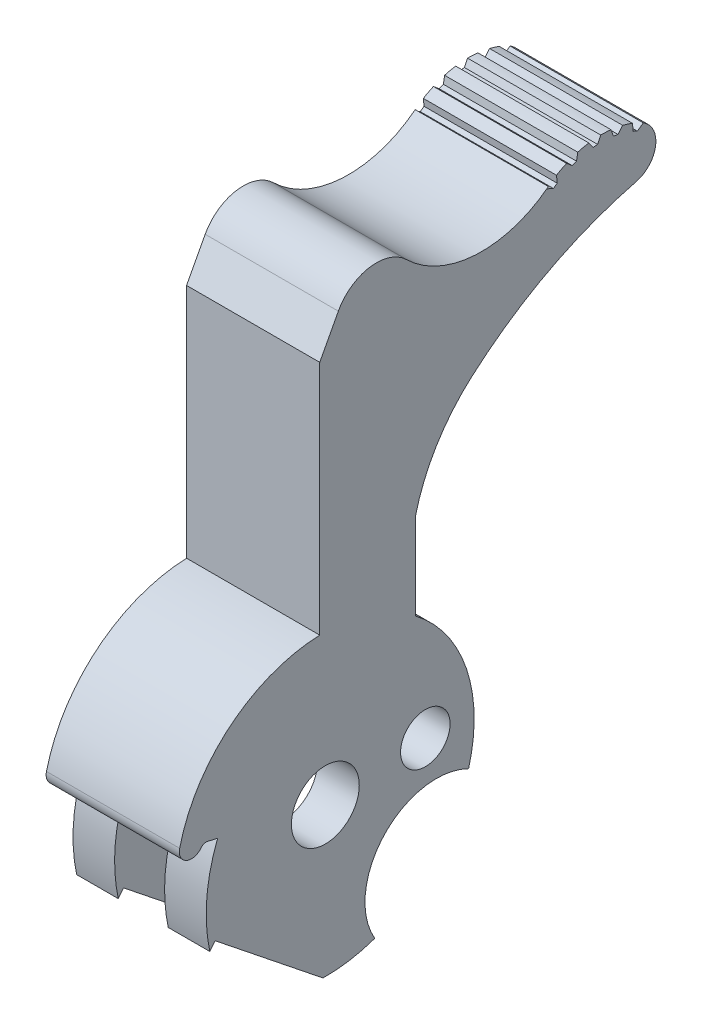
ISO-10303-21;
HEADER;
FILE_DESCRIPTION(('STEP AP214'),'2;1');
FILE_NAME('part.step','',(''),(''),'','','');
FILE_SCHEMA(('AUTOMOTIVE_DESIGN { 1 0 10303 214 1 1 1 1 }'));
ENDSEC;
DATA;
#1=APPLICATION_CONTEXT('core data for automotive mechanical design processes');
#2=APPLICATION_PROTOCOL_DEFINITION('international standard','automotive_design',2000,#1);
#3=PRODUCT_CONTEXT('',#1,'mechanical');
#4=PRODUCT('Part','Part','',(#3));
#5=PRODUCT_RELATED_PRODUCT_CATEGORY('part','',(#4));
#6=PRODUCT_DEFINITION_FORMATION('','',#4);
#7=PRODUCT_DEFINITION_CONTEXT('part definition',#1,'design');
#8=PRODUCT_DEFINITION('design','',#6,#7);
#9=PRODUCT_DEFINITION_SHAPE('','',#8);
#10=(LENGTH_UNIT() NAMED_UNIT(*) SI_UNIT(.MILLI.,.METRE.));
#11=(NAMED_UNIT(*) PLANE_ANGLE_UNIT() SI_UNIT($,.RADIAN.));
#12=(NAMED_UNIT(*) SI_UNIT($,.STERADIAN.) SOLID_ANGLE_UNIT());
#13=UNCERTAINTY_MEASURE_WITH_UNIT(LENGTH_MEASURE(1.E-05),#10,'distance_accuracy_value','');
#14=(GEOMETRIC_REPRESENTATION_CONTEXT(3) GLOBAL_UNCERTAINTY_ASSIGNED_CONTEXT((#13)) GLOBAL_UNIT_ASSIGNED_CONTEXT((#10,
#11,#12)) REPRESENTATION_CONTEXT('',''));
#15=CARTESIAN_POINT('',(0.,0.,0.));
#16=DIRECTION('',(0.,0.,1.));
#17=DIRECTION('',(1.,0.,0.));
#18=AXIS2_PLACEMENT_3D('',#15,#16,#17);
#19=CARTESIAN_POINT('',(3.9243,-3.69241986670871,6.4941349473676));
#20=DIRECTION('',(0.,-0.624225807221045,-0.781243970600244));
#21=DIRECTION('',(0.,0.781243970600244,-0.624225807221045));
#22=AXIS2_PLACEMENT_3D('',#19,#20,#21);
#23=PLANE('',#22);
#24=DIRECTION('',(-1.,0.,0.));
#25=VECTOR('',#24,1.);
#26=CARTESIAN_POINT('',(3.9243,-3.69241986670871,6.4941349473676));
#27=LINE('',#26,#25);
#28=CARTESIAN_POINT('',(-1.4732,-3.69241986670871,6.4941349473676));
#29=VERTEX_POINT('',#28);
#30=CARTESIAN_POINT('',(-3.9243,-3.69241986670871,6.4941349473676));
#31=VERTEX_POINT('',#30);
#32=EDGE_CURVE('E654',#29,#31,#27,.T.);
#33=ORIENTED_EDGE('',*,*,#32,.F.);
#34=DIRECTION('',(0.,-0.781243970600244,0.624225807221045));
#35=VECTOR('',#34,1.);
#36=CARTESIAN_POINT('',(-1.4732,-3.69241986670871,6.4941349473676));
#37=LINE('',#36,#35);
#38=CARTESIAN_POINT('',(-1.4732,-4.08447375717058,6.80739196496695));
#39=VERTEX_POINT('',#38);
#40=EDGE_CURVE('E344',#29,#39,#37,.T.);
#41=ORIENTED_EDGE('',*,*,#40,.T.);
#42=DIRECTION('',(-1.,0.,0.));
#43=VECTOR('',#42,1.);
#44=CARTESIAN_POINT('',(3.9243,-4.08447375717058,6.80739196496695));
#45=LINE('',#44,#43);
#46=CARTESIAN_POINT('',(-3.9243,-4.08447375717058,6.80739196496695));
#47=VERTEX_POINT('',#46);
#48=EDGE_CURVE('E342',#39,#47,#45,.T.);
#49=ORIENTED_EDGE('',*,*,#48,.T.);
#50=DIRECTION('',(0.,-0.781243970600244,0.624225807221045));
#51=VECTOR('',#50,1.);
#52=CARTESIAN_POINT('',(-3.9243,-3.69241986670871,6.4941349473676));
#53=LINE('',#52,#51);
#54=EDGE_CURVE('E581',#31,#47,#53,.T.);
#55=ORIENTED_EDGE('',*,*,#54,.F.);
#56=EDGE_LOOP('',(#33,#41,#49,#55));
#57=FACE_BOUND('',#56,.T.);
#58=ADVANCED_FACE('F34',(#57),#23,.T.);
#59=CARTESIAN_POINT('',(3.9243,-3.69241986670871,6.4941349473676));
#60=DIRECTION('',(0.,0.781243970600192,-0.62422580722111));
#61=DIRECTION('',(0.,0.62422580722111,0.781243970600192));
#62=AXIS2_PLACEMENT_3D('',#59,#60,#61);
#63=PLANE('',#62);
#64=DIRECTION('',(0.,-0.62422580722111,-0.781243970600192));
#65=VECTOR('',#64,1.);
#66=CARTESIAN_POINT('',(-1.4732,-3.69241986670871,6.4941349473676));
#67=LINE('',#66,#65);
#68=CARTESIAN_POINT('',(-1.4732,-8.77090621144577,0.138202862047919));
#69=VERTEX_POINT('',#68);
#70=EDGE_CURVE('E348',#29,#69,#67,.T.);
#71=ORIENTED_EDGE('',*,*,#70,.F.);
#72=ORIENTED_EDGE('',*,*,#32,.T.);
#73=DIRECTION('',(0.,-0.62422580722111,-0.781243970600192));
#74=VECTOR('',#73,1.);
#75=CARTESIAN_POINT('',(-3.9243,-3.69241986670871,6.4941349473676));
#76=LINE('',#75,#74);
#77=CARTESIAN_POINT('',(-3.9243,-8.77090621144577,0.138202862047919));
#78=VERTEX_POINT('',#77);
#79=EDGE_CURVE('E584',#31,#78,#76,.T.);
#80=ORIENTED_EDGE('',*,*,#79,.T.);
#81=DIRECTION('',(-1.,0.,0.));
#82=VECTOR('',#81,1.);
#83=CARTESIAN_POINT('',(3.9243,-8.77090621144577,0.138202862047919));
#84=LINE('',#83,#82);
#85=EDGE_CURVE('E650',#69,#78,#84,.T.);
#86=ORIENTED_EDGE('',*,*,#85,.F.);
#87=EDGE_LOOP('',(#71,#72,#80,#86));
#88=FACE_BOUND('',#87,.T.);
#89=ADVANCED_FACE('F692',(#88),#63,.F.);
#90=CARTESIAN_POINT('',(3.9243,0.,0.));
#91=DIRECTION('',(-1.,0.,0.));
#92=DIRECTION('',(0.,0.,1.));
#93=AXIS2_PLACEMENT_3D('',#90,#91,#92);
#94=CYLINDRICAL_SURFACE('',#93,8.77199497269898);
#95=CARTESIAN_POINT('',(-1.4732,0.,0.));
#96=DIRECTION('',(1.,0.,0.));
#97=DIRECTION('',(0.,0.,-1.));
#98=AXIS2_PLACEMENT_3D('',#95,#96,#97);
#99=CIRCLE('',#98,8.77199497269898);
#100=CARTESIAN_POINT('',(-1.4732,-8.27424285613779,-2.91286816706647));
#101=VERTEX_POINT('',#100);
#102=EDGE_CURVE('E683',#69,#101,#99,.T.);
#103=ORIENTED_EDGE('',*,*,#102,.F.);
#104=ORIENTED_EDGE('',*,*,#85,.T.);
#105=CARTESIAN_POINT('',(-3.9243,0.,0.));
#106=DIRECTION('',(1.,0.,0.));
#107=DIRECTION('',(0.,0.,-1.));
#108=AXIS2_PLACEMENT_3D('',#105,#106,#107);
#109=CIRCLE('',#108,8.77199497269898);
#110=CARTESIAN_POINT('',(-3.9243,-8.27424285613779,-2.91286816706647));
#111=VERTEX_POINT('',#110);
#112=EDGE_CURVE('E587',#78,#111,#109,.T.);
#113=ORIENTED_EDGE('',*,*,#112,.T.);
#114=DIRECTION('',(-1.,0.,0.));
#115=VECTOR('',#114,1.);
#116=CARTESIAN_POINT('',(3.9243,-8.27424285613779,-2.91286816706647));
#117=LINE('',#116,#115);
#118=EDGE_CURVE('E646',#101,#111,#117,.T.);
#119=ORIENTED_EDGE('',*,*,#118,.F.);
#120=EDGE_LOOP('',(#103,#104,#113,#119));
#121=FACE_BOUND('',#120,.T.);
#122=ADVANCED_FACE('F691',(#121),#94,.T.);
#123=CARTESIAN_POINT('',(3.9243,-6.14680000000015,-6.5532));
#124=DIRECTION('',(-1.,0.,0.));
#125=DIRECTION('',(0.,0.,1.));
#126=AXIS2_PLACEMENT_3D('',#123,#124,#125);
#127=CYLINDRICAL_SURFACE('',#126,4.21640000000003);
#128=DIRECTION('',(-1.,0.,0.));
#129=VECTOR('',#128,1.);
#130=CARTESIAN_POINT('',(3.9243,-2.37789887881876,-8.44354740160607));
#131=LINE('',#130,#129);
#132=CARTESIAN_POINT('',(-1.4732,-2.37789887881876,-8.44354740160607));
#133=VERTEX_POINT('',#132);
#134=CARTESIAN_POINT('',(-3.9243,-2.37789887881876,-8.44354740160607));
#135=VERTEX_POINT('',#134);
#136=EDGE_CURVE('E642',#133,#135,#131,.T.);
#137=ORIENTED_EDGE('',*,*,#136,.F.);
#138=CARTESIAN_POINT('',(-1.4732,-6.14680000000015,-6.5532));
#139=DIRECTION('',(1.,0.,0.));
#140=DIRECTION('',(0.,0.,-1.));
#141=AXIS2_PLACEMENT_3D('',#138,#139,#140);
#142=CIRCLE('',#141,4.21640000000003);
#143=EDGE_CURVE('E49',#133,#101,#142,.T.);
#144=ORIENTED_EDGE('',*,*,#143,.T.);
#145=ORIENTED_EDGE('',*,*,#118,.T.);
#146=CARTESIAN_POINT('',(-3.9243,-6.14680000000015,-6.5532));
#147=DIRECTION('',(1.,0.,0.));
#148=DIRECTION('',(0.,0.,-1.));
#149=AXIS2_PLACEMENT_3D('',#146,#147,#148);
#150=CIRCLE('',#149,4.21640000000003);
#151=EDGE_CURVE('E590',#135,#111,#150,.T.);
#152=ORIENTED_EDGE('',*,*,#151,.F.);
#153=EDGE_LOOP('',(#137,#144,#145,#152));
#154=FACE_BOUND('',#153,.T.);
#155=ADVANCED_FACE('F703',(#154),#127,.F.);
#156=CARTESIAN_POINT('',(-3.9243,0.,0.));
#157=DIRECTION('',(1.,0.,0.));
#158=DIRECTION('',(0.,0.,-1.));
#159=AXIS2_PLACEMENT_3D('',#156,#157,#158);
#160=CYLINDRICAL_SURFACE('',#159,2.00025);
#161=CARTESIAN_POINT('',(-3.9243,0.,0.));
#162=DIRECTION('',(1.,0.,0.));
#163=DIRECTION('',(0.,0.,-1.));
#164=AXIS2_PLACEMENT_3D('',#161,#162,#163);
#165=CIRCLE('',#164,2.00025);
#166=CARTESIAN_POINT('',(-3.9243,0.,-2.00025));
#167=VERTEX_POINT('',#166);
#168=EDGE_CURVE('E508',#167,#167,#165,.T.);
#169=ORIENTED_EDGE('',*,*,#168,.F.);
#170=EDGE_LOOP('',(#169));
#171=FACE_BOUND('',#170,.T.);
#172=CARTESIAN_POINT('',(-1.4732,0.,0.));
#173=DIRECTION('',(1.,0.,0.));
#174=DIRECTION('',(0.,0.,-1.));
#175=AXIS2_PLACEMENT_3D('',#172,#173,#174);
#176=CIRCLE('',#175,2.00025);
#177=CARTESIAN_POINT('',(-1.4732,0.,-2.00025));
#178=VERTEX_POINT('',#177);
#179=EDGE_CURVE('E673',#178,#178,#176,.F.);
#180=ORIENTED_EDGE('',*,*,#179,.F.);
#181=EDGE_LOOP('',(#180));
#182=FACE_BOUND('',#181,.T.);
#183=ADVANCED_FACE('F861',(#171,#182),#160,.F.);
#184=CARTESIAN_POINT('',(-3.9243,0.4572,-5.8928));
#185=DIRECTION('',(1.,0.,0.));
#186=DIRECTION('',(0.,0.,-1.));
#187=AXIS2_PLACEMENT_3D('',#184,#185,#186);
#188=CYLINDRICAL_SURFACE('',#187,1.46015460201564);
#189=CARTESIAN_POINT('',(-3.9243,0.4572,-5.8928));
#190=DIRECTION('',(1.,0.,0.));
#191=DIRECTION('',(0.,0.,-1.));
#192=AXIS2_PLACEMENT_3D('',#189,#190,#191);
#193=CIRCLE('',#192,1.46015460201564);
#194=CARTESIAN_POINT('',(-3.9243,0.4572,-7.35295460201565));
#195=VERTEX_POINT('',#194);
#196=EDGE_CURVE('E495',#195,#195,#193,.T.);
#197=ORIENTED_EDGE('',*,*,#196,.F.);
#198=EDGE_LOOP('',(#197));
#199=FACE_BOUND('',#198,.T.);
#200=CARTESIAN_POINT('',(-1.4732,0.4572,-5.8928));
#201=DIRECTION('',(1.,0.,0.));
#202=DIRECTION('',(0.,0.,-1.));
#203=AXIS2_PLACEMENT_3D('',#200,#201,#202);
#204=CIRCLE('',#203,1.46015460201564);
#205=CARTESIAN_POINT('',(-1.4732,0.4572,-7.35295460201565));
#206=VERTEX_POINT('',#205);
#207=EDGE_CURVE('E671',#206,#206,#204,.F.);
#208=ORIENTED_EDGE('',*,*,#207,.F.);
#209=EDGE_LOOP('',(#208));
#210=FACE_BOUND('',#209,.T.);
#211=ADVANCED_FACE('F857',(#199,#210),#188,.F.);
#212=CARTESIAN_POINT('',(3.9243,20.9927464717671,-16.2836505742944));
#213=DIRECTION('',(-1.,0.,0.));
#214=DIRECTION('',(0.,0.,1.));
#215=AXIS2_PLACEMENT_3D('',#212,#213,#214);
#216=CYLINDRICAL_SURFACE('',#215,5.08);
#217=CARTESIAN_POINT('',(-3.9243,20.9927464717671,-16.2836505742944));
#218=DIRECTION('',(1.,0.,0.));
#219=DIRECTION('',(0.,0.,-1.));
#220=AXIS2_PLACEMENT_3D('',#217,#218,#219);
#221=CIRCLE('',#220,5.08);
#222=CARTESIAN_POINT('',(-3.9243,25.634030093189,-14.2184904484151));
#223=VERTEX_POINT('',#222);
#224=CARTESIAN_POINT('',(-3.9243,25.321955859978,-13.6257668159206));
#225=VERTEX_POINT('',#224);
#226=EDGE_CURVE('E608',#223,#225,#221,.T.);
#227=ORIENTED_EDGE('',*,*,#226,.T.);
#228=DIRECTION('',(-1.,0.,0.));
#229=VECTOR('',#228,1.);
#230=CARTESIAN_POINT('',(3.9243,25.321955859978,-13.6257668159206));
#231=LINE('',#230,#229);
#232=CARTESIAN_POINT('',(3.9243,25.321955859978,-13.6257668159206));
#233=VERTEX_POINT('',#232);
#234=EDGE_CURVE('E404',#233,#225,#231,.T.);
#235=ORIENTED_EDGE('',*,*,#234,.F.);
#236=CARTESIAN_POINT('',(3.9243,20.9927464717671,-16.2836505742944));
#237=DIRECTION('',(1.,0.,0.));
#238=DIRECTION('',(0.,0.,-1.));
#239=AXIS2_PLACEMENT_3D('',#236,#237,#238);
#240=CIRCLE('',#239,5.08);
#241=CARTESIAN_POINT('',(3.9243,25.634030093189,-14.2184904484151));
#242=VERTEX_POINT('',#241);
#243=EDGE_CURVE('E552',#242,#233,#240,.T.);
#244=ORIENTED_EDGE('',*,*,#243,.F.);
#245=DIRECTION('',(-1.,0.,0.));
#246=VECTOR('',#245,1.);
#247=CARTESIAN_POINT('',(3.9243,25.634030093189,-14.2184904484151));
#248=LINE('',#247,#246);
#249=EDGE_CURVE('E439',#242,#223,#248,.T.);
#250=ORIENTED_EDGE('',*,*,#249,.T.);
#251=EDGE_LOOP('',(#227,#235,#244,#250));
#252=FACE_BOUND('',#251,.T.);
#253=ADVANCED_FACE('F808',(#252),#216,.T.);
#254=CARTESIAN_POINT('',(3.9243,26.0426322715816,-16.8359669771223));
#255=VERTEX_POINT('',#254);
#256=CARTESIAN_POINT('',(3.9243,26.0724822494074,-16.231839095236));
#257=VERTEX_POINT('',#256);
#258=EDGE_CURVE('E556',#255,#257,#240,.T.);
#259=ORIENTED_EDGE('',*,*,#258,.F.);
#260=DIRECTION('',(-1.,0.,0.));
#261=VECTOR('',#260,1.);
#262=CARTESIAN_POINT('',(3.9243,26.0426322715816,-16.8359669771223));
#263=LINE('',#262,#261);
#264=CARTESIAN_POINT('',(-3.9243,26.0426322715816,-16.8359669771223));
#265=VERTEX_POINT('',#264);
#266=EDGE_CURVE('E465',#255,#265,#263,.T.);
#267=ORIENTED_EDGE('',*,*,#266,.T.);
#268=CARTESIAN_POINT('',(-3.9243,26.0724822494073,-16.231839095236));
#269=VERTEX_POINT('',#268);
#270=EDGE_CURVE('E612',#265,#269,#221,.T.);
#271=ORIENTED_EDGE('',*,*,#270,.T.);
#272=DIRECTION('',(-1.,0.,0.));
#273=VECTOR('',#272,1.);
#274=CARTESIAN_POINT('',(3.9243,26.0724822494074,-16.231839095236));
#275=LINE('',#274,#273);
#276=EDGE_CURVE('E485',#257,#269,#275,.T.);
#277=ORIENTED_EDGE('',*,*,#276,.F.);
#278=EDGE_LOOP('',(#259,#267,#271,#277));
#279=FACE_BOUND('',#278,.T.);
#280=ADVANCED_FACE('F820',(#279),#216,.T.);
#281=CARTESIAN_POINT('',(-3.9243,26.0168773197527,-15.5323122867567));
#282=VERTEX_POINT('',#281);
#283=CARTESIAN_POINT('',(-3.9243,25.8743410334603,-14.8777933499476));
#284=VERTEX_POINT('',#283);
#285=EDGE_CURVE('E613',#282,#284,#221,.T.);
#286=ORIENTED_EDGE('',*,*,#285,.T.);
#287=DIRECTION('',(-1.,0.,0.));
#288=VECTOR('',#287,1.);
#289=CARTESIAN_POINT('',(3.9243,25.8743410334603,-14.8777933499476));
#290=LINE('',#289,#288);
#291=CARTESIAN_POINT('',(3.9243,25.8743410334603,-14.8777933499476));
#292=VERTEX_POINT('',#291);
#293=EDGE_CURVE('E432',#292,#284,#290,.T.);
#294=ORIENTED_EDGE('',*,*,#293,.F.);
#295=CARTESIAN_POINT('',(3.9243,26.0168773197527,-15.5323122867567));
#296=VERTEX_POINT('',#295);
#297=EDGE_CURVE('E557',#296,#292,#240,.T.);
#298=ORIENTED_EDGE('',*,*,#297,.F.);
#299=DIRECTION('',(-1.,0.,0.));
#300=VECTOR('',#299,1.);
#301=CARTESIAN_POINT('',(3.9243,26.0168773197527,-15.5323122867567));
#302=LINE('',#301,#300);
#303=EDGE_CURVE('E492',#296,#282,#302,.T.);
#304=ORIENTED_EDGE('',*,*,#303,.T.);
#305=EDGE_LOOP('',(#286,#294,#298,#304));
#306=FACE_BOUND('',#305,.T.);
#307=ADVANCED_FACE('F764',(#306),#216,.T.);
#308=CARTESIAN_POINT('',(3.9243,0.,0.));
#309=DIRECTION('',(-1.,0.,0.));
#310=DIRECTION('',(0.,0.,1.));
#311=AXIS2_PLACEMENT_3D('',#308,#309,#310);
#312=CYLINDRICAL_SURFACE('',#311,8.83314197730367);
#313=CARTESIAN_POINT('',(-3.9243,0.,0.));
#314=DIRECTION('',(1.,0.,0.));
#315=DIRECTION('',(0.,0.,-1.));
#316=AXIS2_PLACEMENT_3D('',#313,#314,#315);
#317=CIRCLE('',#316,8.83314197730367);
#318=CARTESIAN_POINT('',(-3.9243,8.82696806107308,0.3302));
#319=VERTEX_POINT('',#318);
#320=CARTESIAN_POINT('',(-3.9243,2.07192066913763,8.58670728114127));
#321=VERTEX_POINT('',#320);
#322=EDGE_CURVE('E511',#319,#321,#317,.T.);
#323=ORIENTED_EDGE('',*,*,#322,.T.);
#324=DIRECTION('',(-1.,0.,0.));
#325=VECTOR('',#324,1.);
#326=CARTESIAN_POINT('',(3.9243,2.07192066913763,8.58670728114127));
#327=LINE('',#326,#325);
#328=CARTESIAN_POINT('',(3.9243,2.07192066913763,8.58670728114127));
#329=VERTEX_POINT('',#328);
#330=EDGE_CURVE('E667',#329,#321,#327,.T.);
#331=ORIENTED_EDGE('',*,*,#330,.F.);
#332=CARTESIAN_POINT('',(3.9243,0.,0.));
#333=DIRECTION('',(1.,0.,0.));
#334=DIRECTION('',(0.,0.,-1.));
#335=AXIS2_PLACEMENT_3D('',#332,#333,#334);
#336=CIRCLE('',#335,8.83314197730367);
#337=CARTESIAN_POINT('',(3.9243,8.82696806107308,0.3302));
#338=VERTEX_POINT('',#337);
#339=EDGE_CURVE('E514',#338,#329,#336,.T.);
#340=ORIENTED_EDGE('',*,*,#339,.F.);
#341=DIRECTION('',(-1.,0.,0.));
#342=VECTOR('',#341,1.);
#343=CARTESIAN_POINT('',(3.9243,8.82696806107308,0.3302));
#344=LINE('',#343,#342);
#345=EDGE_CURVE('E567',#338,#319,#344,.T.);
#346=ORIENTED_EDGE('',*,*,#345,.T.);
#347=EDGE_LOOP('',(#323,#331,#340,#346));
#348=FACE_BOUND('',#347,.T.);
#349=ADVANCED_FACE('F36',(#348),#312,.T.);
#350=CARTESIAN_POINT('',(3.9243,1.90381393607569,7.8900187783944));
#351=DIRECTION('',(-1.,0.,0.));
#352=DIRECTION('',(0.,0.,1.));
#353=AXIS2_PLACEMENT_3D('',#350,#351,#352);
#354=CYLINDRICAL_SURFACE('',#353,0.716683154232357);
#355=CARTESIAN_POINT('',(-3.9243,1.90381393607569,7.8900187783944));
#356=DIRECTION('',(1.,0.,0.));
#357=DIRECTION('',(0.,0.,-1.));
#358=AXIS2_PLACEMENT_3D('',#355,#356,#357);
#359=CIRCLE('',#358,0.716683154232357);
#360=CARTESIAN_POINT('',(-3.9243,1.4641413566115,7.32404813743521));
#361=VERTEX_POINT('',#360);
#362=EDGE_CURVE('E570',#321,#361,#359,.T.);
#363=ORIENTED_EDGE('',*,*,#362,.T.);
#364=DIRECTION('',(-1.,0.,0.));
#365=VECTOR('',#364,1.);
#366=CARTESIAN_POINT('',(3.9243,1.4641413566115,7.32404813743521));
#367=LINE('',#366,#365);
#368=CARTESIAN_POINT('',(3.9243,1.4641413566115,7.32404813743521));
#369=VERTEX_POINT('',#368);
#370=EDGE_CURVE('E665',#369,#361,#367,.T.);
#371=ORIENTED_EDGE('',*,*,#370,.F.);
#372=CARTESIAN_POINT('',(3.9243,1.90381393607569,7.8900187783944));
#373=DIRECTION('',(1.,0.,0.));
#374=DIRECTION('',(0.,0.,-1.));
#375=AXIS2_PLACEMENT_3D('',#372,#373,#374);
#376=CIRCLE('',#375,0.716683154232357);
#377=EDGE_CURVE('E517',#329,#369,#376,.T.);
#378=ORIENTED_EDGE('',*,*,#377,.F.);
#379=ORIENTED_EDGE('',*,*,#330,.T.);
#380=EDGE_LOOP('',(#363,#371,#378,#379));
#381=FACE_BOUND('',#380,.T.);
#382=ADVANCED_FACE('F757',(#381),#354,.T.);
#383=CARTESIAN_POINT('',(3.9243,1.23040452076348,7.02316927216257));
#384=DIRECTION('',(-1.,0.,0.));
#385=DIRECTION('',(0.,0.,1.));
#386=AXIS2_PLACEMENT_3D('',#383,#384,#385);
#387=CYLINDRICAL_SURFACE('',#386,0.380999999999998);
#388=CARTESIAN_POINT('',(-3.9243,1.23040452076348,7.02316927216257));
#389=DIRECTION('',(1.,0.,0.));
#390=DIRECTION('',(0.,0.,-1.));
#391=AXIS2_PLACEMENT_3D('',#388,#389,#390);
#392=CIRCLE('',#391,0.380999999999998);
#393=CARTESIAN_POINT('',(-3.9243,1.60163951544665,6.93746292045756));
#394=VERTEX_POINT('',#393);
#395=EDGE_CURVE('E573',#394,#361,#392,.T.);
#396=ORIENTED_EDGE('',*,*,#395,.F.);
#397=DIRECTION('',(-1.,0.,0.));
#398=VECTOR('',#397,1.);
#399=CARTESIAN_POINT('',(3.9243,1.60163951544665,6.93746292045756));
#400=LINE('',#399,#398);
#401=CARTESIAN_POINT('',(3.9243,1.60163951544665,6.93746292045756));
#402=VERTEX_POINT('',#401);
#403=EDGE_CURVE('E663',#402,#394,#400,.T.);
#404=ORIENTED_EDGE('',*,*,#403,.F.);
#405=CARTESIAN_POINT('',(3.9243,1.23040452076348,7.02316927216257));
#406=DIRECTION('',(1.,0.,0.));
#407=DIRECTION('',(0.,0.,-1.));
#408=AXIS2_PLACEMENT_3D('',#405,#406,#407);
#409=CIRCLE('',#408,0.380999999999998);
#410=EDGE_CURVE('E520',#402,#369,#409,.T.);
#411=ORIENTED_EDGE('',*,*,#410,.T.);
#412=ORIENTED_EDGE('',*,*,#370,.T.);
#413=EDGE_LOOP('',(#396,#404,#411,#412));
#414=FACE_BOUND('',#413,.T.);
#415=ADVANCED_FACE('F753',(#414),#387,.F.);
#416=CARTESIAN_POINT('',(3.9243,1.46552820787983,6.34790007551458));
#417=DIRECTION('',(0.,-0.974370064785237,0.224951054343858));
#418=DIRECTION('',(0.,-0.224951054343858,-0.974370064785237));
#419=AXIS2_PLACEMENT_3D('',#416,#417,#418);
#420=PLANE('',#419);
#421=DIRECTION('',(0.,0.224951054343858,0.974370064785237));
#422=VECTOR('',#421,1.);
#423=CARTESIAN_POINT('',(-3.9243,1.46552820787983,6.34790007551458));
#424=LINE('',#423,#422);
#425=CARTESIAN_POINT('',(-3.9243,1.46552820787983,6.34790007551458));
#426=VERTEX_POINT('',#425);
#427=EDGE_CURVE('E576',#426,#394,#424,.T.);
#428=ORIENTED_EDGE('',*,*,#427,.F.);
#429=DIRECTION('',(-1.,0.,0.));
#430=VECTOR('',#429,1.);
#431=CARTESIAN_POINT('',(3.9243,1.46552820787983,6.34790007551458));
#432=LINE('',#431,#430);
#433=CARTESIAN_POINT('',(3.9243,1.46552820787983,6.34790007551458));
#434=VERTEX_POINT('',#433);
#435=EDGE_CURVE('E661',#434,#426,#432,.T.);
#436=ORIENTED_EDGE('',*,*,#435,.F.);
#437=DIRECTION('',(0.,0.224951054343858,0.974370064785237));
#438=VECTOR('',#437,1.);
#439=CARTESIAN_POINT('',(3.9243,1.46552820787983,6.34790007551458));
#440=LINE('',#439,#438);
#441=EDGE_CURVE('E523',#434,#402,#440,.T.);
#442=ORIENTED_EDGE('',*,*,#441,.T.);
#443=ORIENTED_EDGE('',*,*,#403,.T.);
#444=EDGE_LOOP('',(#428,#436,#442,#443));
#445=FACE_BOUND('',#444,.T.);
#446=ADVANCED_FACE('F735',(#445),#420,.T.);
#447=CARTESIAN_POINT('',(3.9243,-2.06542162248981,-2.55313014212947));
#448=DIRECTION('',(-1.,0.,0.));
#449=DIRECTION('',(0.,0.,1.));
#450=AXIS2_PLACEMENT_3D('',#447,#448,#449);
#451=CYLINDRICAL_SURFACE('',#450,9.5758);
#452=DIRECTION('',(-1.,0.,0.));
#453=VECTOR('',#452,1.);
#454=CARTESIAN_POINT('',(3.9243,0.935933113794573,6.54015393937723));
#455=LINE('',#454,#453);
#456=CARTESIAN_POINT('',(-1.4732,0.935933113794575,6.54015393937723));
#457=VERTEX_POINT('',#456);
#458=CARTESIAN_POINT('',(1.4732,0.935933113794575,6.54015393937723));
#459=VERTEX_POINT('',#458);
#460=EDGE_CURVE('E322',#457,#459,#455,.F.);
#461=ORIENTED_EDGE('',*,*,#460,.T.);
#462=CARTESIAN_POINT('',(1.4732,-2.06542162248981,-2.55313014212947));
#463=DIRECTION('',(1.,0.,0.));
#464=DIRECTION('',(0.,0.,-1.));
#465=AXIS2_PLACEMENT_3D('',#462,#463,#464);
#466=CIRCLE('',#465,9.5758);
#467=CARTESIAN_POINT('',(1.4732,-4.08447375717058,6.80739196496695));
#468=VERTEX_POINT('',#467);
#469=EDGE_CURVE('E332',#459,#468,#466,.T.);
#470=ORIENTED_EDGE('',*,*,#469,.T.);
#471=CARTESIAN_POINT('',(3.9243,-4.08447375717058,6.80739196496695));
#472=VERTEX_POINT('',#471);
#473=EDGE_CURVE('E658',#472,#468,#45,.T.);
#474=ORIENTED_EDGE('',*,*,#473,.F.);
#475=CARTESIAN_POINT('',(3.9243,-2.06542162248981,-2.55313014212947));
#476=DIRECTION('',(1.,0.,0.));
#477=DIRECTION('',(0.,0.,-1.));
#478=AXIS2_PLACEMENT_3D('',#475,#476,#477);
#479=CIRCLE('',#478,9.5758);
#480=EDGE_CURVE('E526',#434,#472,#479,.T.);
#481=ORIENTED_EDGE('',*,*,#480,.F.);
#482=ORIENTED_EDGE('',*,*,#435,.T.);
#483=CARTESIAN_POINT('',(-3.9243,-2.06542162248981,-2.55313014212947));
#484=DIRECTION('',(1.,0.,0.));
#485=DIRECTION('',(0.,0.,-1.));
#486=AXIS2_PLACEMENT_3D('',#483,#484,#485);
#487=CIRCLE('',#486,9.5758);
#488=EDGE_CURVE('E579',#426,#47,#487,.T.);
#489=ORIENTED_EDGE('',*,*,#488,.T.);
#490=ORIENTED_EDGE('',*,*,#48,.F.);
#491=CARTESIAN_POINT('',(-1.4732,-2.06542162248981,-2.55313014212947));
#492=DIRECTION('',(1.,0.,0.));
#493=DIRECTION('',(0.,0.,-1.));
#494=AXIS2_PLACEMENT_3D('',#491,#492,#493);
#495=CIRCLE('',#494,9.5758);
#496=EDGE_CURVE('E335',#457,#39,#495,.T.);
#497=ORIENTED_EDGE('',*,*,#496,.F.);
#498=EDGE_LOOP('',(#461,#470,#474,#481,#482,#489,#490,#497));
#499=FACE_BOUND('',#498,.T.);
#500=ADVANCED_FACE('F340',(#499),#451,.T.);
#501=DIRECTION('',(0.,-0.781243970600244,0.624225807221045));
#502=VECTOR('',#501,1.);
#503=CARTESIAN_POINT('',(1.4732,-3.69241986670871,6.4941349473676));
#504=LINE('',#503,#502);
#505=CARTESIAN_POINT('',(1.4732,-3.69241986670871,6.4941349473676));
#506=VERTEX_POINT('',#505);
#507=EDGE_CURVE('E365',#506,#468,#504,.T.);
#508=ORIENTED_EDGE('',*,*,#507,.F.);
#509=CARTESIAN_POINT('',(3.9243,-3.69241986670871,6.4941349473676));
#510=VERTEX_POINT('',#509);
#511=EDGE_CURVE('E655',#510,#506,#27,.T.);
#512=ORIENTED_EDGE('',*,*,#511,.F.);
#513=DIRECTION('',(0.,-0.781243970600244,0.624225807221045));
#514=VECTOR('',#513,1.);
#515=CARTESIAN_POINT('',(3.9243,-3.69241986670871,6.4941349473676));
#516=LINE('',#515,#514);
#517=EDGE_CURVE('E528',#510,#472,#516,.T.);
#518=ORIENTED_EDGE('',*,*,#517,.T.);
#519=ORIENTED_EDGE('',*,*,#473,.T.);
#520=EDGE_LOOP('',(#508,#512,#518,#519));
#521=FACE_BOUND('',#520,.T.);
#522=ADVANCED_FACE('F724',(#521),#23,.T.);
#523=ORIENTED_EDGE('',*,*,#511,.T.);
#524=DIRECTION('',(0.,-0.62422580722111,-0.781243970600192));
#525=VECTOR('',#524,1.);
#526=CARTESIAN_POINT('',(1.4732,-3.69241986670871,6.4941349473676));
#527=LINE('',#526,#525);
#528=CARTESIAN_POINT('',(1.4732,-8.77090621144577,0.138202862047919));
#529=VERTEX_POINT('',#528);
#530=EDGE_CURVE('E362',#506,#529,#527,.T.);
#531=ORIENTED_EDGE('',*,*,#530,.T.);
#532=CARTESIAN_POINT('',(3.9243,-8.77090621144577,0.138202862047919));
#533=VERTEX_POINT('',#532);
#534=EDGE_CURVE('E651',#533,#529,#84,.T.);
#535=ORIENTED_EDGE('',*,*,#534,.F.);
#536=DIRECTION('',(0.,-0.62422580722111,-0.781243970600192));
#537=VECTOR('',#536,1.);
#538=CARTESIAN_POINT('',(3.9243,-3.69241986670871,6.4941349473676));
#539=LINE('',#538,#537);
#540=EDGE_CURVE('E531',#510,#533,#539,.T.);
#541=ORIENTED_EDGE('',*,*,#540,.F.);
#542=EDGE_LOOP('',(#523,#531,#535,#541));
#543=FACE_BOUND('',#542,.T.);
#544=ADVANCED_FACE('F720',(#543),#63,.F.);
#545=ORIENTED_EDGE('',*,*,#534,.T.);
#546=CARTESIAN_POINT('',(1.4732,0.,0.));
#547=DIRECTION('',(1.,0.,0.));
#548=DIRECTION('',(0.,0.,-1.));
#549=AXIS2_PLACEMENT_3D('',#546,#547,#548);
#550=CIRCLE('',#549,8.77199497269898);
#551=CARTESIAN_POINT('',(1.4732,-8.27424285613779,-2.91286816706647));
#552=VERTEX_POINT('',#551);
#553=EDGE_CURVE('E359',#529,#552,#550,.T.);
#554=ORIENTED_EDGE('',*,*,#553,.T.);
#555=CARTESIAN_POINT('',(3.9243,-8.27424285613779,-2.91286816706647));
#556=VERTEX_POINT('',#555);
#557=EDGE_CURVE('E647',#556,#552,#117,.T.);
#558=ORIENTED_EDGE('',*,*,#557,.F.);
#559=CARTESIAN_POINT('',(3.9243,0.,0.));
#560=DIRECTION('',(1.,0.,0.));
#561=DIRECTION('',(0.,0.,-1.));
#562=AXIS2_PLACEMENT_3D('',#559,#560,#561);
#563=CIRCLE('',#562,8.77199497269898);
#564=EDGE_CURVE('E533',#533,#556,#563,.T.);
#565=ORIENTED_EDGE('',*,*,#564,.F.);
#566=EDGE_LOOP('',(#545,#554,#558,#565));
#567=FACE_BOUND('',#566,.T.);
#568=ADVANCED_FACE('F716',(#567),#94,.T.);
#569=CARTESIAN_POINT('',(1.4732,-6.14680000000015,-6.5532));
#570=DIRECTION('',(1.,0.,0.));
#571=DIRECTION('',(0.,0.,-1.));
#572=AXIS2_PLACEMENT_3D('',#569,#570,#571);
#573=CIRCLE('',#572,4.21640000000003);
#574=CARTESIAN_POINT('',(1.4732,-2.37789887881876,-8.44354740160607));
#575=VERTEX_POINT('',#574);
#576=EDGE_CURVE('E357',#575,#552,#573,.T.);
#577=ORIENTED_EDGE('',*,*,#576,.F.);
#578=CARTESIAN_POINT('',(3.9243,-2.37789887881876,-8.44354740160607));
#579=VERTEX_POINT('',#578);
#580=EDGE_CURVE('E643',#579,#575,#131,.T.);
#581=ORIENTED_EDGE('',*,*,#580,.F.);
#582=CARTESIAN_POINT('',(3.9243,-6.14680000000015,-6.5532));
#583=DIRECTION('',(1.,0.,0.));
#584=DIRECTION('',(0.,0.,-1.));
#585=AXIS2_PLACEMENT_3D('',#582,#583,#584);
#586=CIRCLE('',#585,4.21640000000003);
#587=EDGE_CURVE('E535',#579,#556,#586,.T.);
#588=ORIENTED_EDGE('',*,*,#587,.T.);
#589=ORIENTED_EDGE('',*,*,#557,.T.);
#590=EDGE_LOOP('',(#577,#581,#588,#589));
#591=FACE_BOUND('',#590,.T.);
#592=ADVANCED_FACE('F711',(#591),#127,.F.);
#593=CARTESIAN_POINT('',(3.9243,0.,0.));
#594=DIRECTION('',(-1.,0.,0.));
#595=DIRECTION('',(0.,0.,1.));
#596=AXIS2_PLACEMENT_3D('',#593,#594,#595);
#597=CYLINDRICAL_SURFACE('',#596,8.77199497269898);
#598=ORIENTED_EDGE('',*,*,#580,.T.);
#599=CARTESIAN_POINT('',(1.4732,0.,0.));
#600=DIRECTION('',(1.,0.,0.));
#601=DIRECTION('',(0.,0.,-1.));
#602=AXIS2_PLACEMENT_3D('',#599,#600,#601);
#603=CIRCLE('',#602,8.77199497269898);
#604=CARTESIAN_POINT('',(1.4732,3.50689516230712,-8.04049638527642));
#605=VERTEX_POINT('',#604);
#606=EDGE_CURVE('E354',#575,#605,#603,.T.);
#607=ORIENTED_EDGE('',*,*,#606,.T.);
#608=DIRECTION('',(-1.,0.,0.));
#609=VECTOR('',#608,1.);
#610=CARTESIAN_POINT('',(3.9243,3.50689516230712,-8.04049638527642));
#611=LINE('',#610,#609);
#612=CARTESIAN_POINT('',(-1.4732,3.50689516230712,-8.04049638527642));
#613=VERTEX_POINT('',#612);
#614=EDGE_CURVE('E11',#605,#613,#611,.T.);
#615=ORIENTED_EDGE('',*,*,#614,.T.);
#616=CARTESIAN_POINT('',(-1.4732,0.,0.));
#617=DIRECTION('',(1.,0.,0.));
#618=DIRECTION('',(0.,0.,-1.));
#619=AXIS2_PLACEMENT_3D('',#616,#617,#618);
#620=CIRCLE('',#619,8.77199497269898);
#621=EDGE_CURVE('E337',#133,#613,#620,.T.);
#622=ORIENTED_EDGE('',*,*,#621,.F.);
#623=ORIENTED_EDGE('',*,*,#136,.T.);
#624=CARTESIAN_POINT('',(-3.9243,0.,0.));
#625=DIRECTION('',(1.,0.,0.));
#626=DIRECTION('',(0.,0.,-1.));
#627=AXIS2_PLACEMENT_3D('',#624,#625,#626);
#628=CIRCLE('',#627,8.77199497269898);
#629=CARTESIAN_POINT('',(-3.9243,6.9833130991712,-5.30860000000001));
#630=VERTEX_POINT('',#629);
#631=EDGE_CURVE('E593',#135,#630,#628,.T.);
#632=ORIENTED_EDGE('',*,*,#631,.T.);
#633=DIRECTION('',(-1.,0.,0.));
#634=VECTOR('',#633,1.);
#635=CARTESIAN_POINT('',(3.9243,6.9833130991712,-5.30860000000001));
#636=LINE('',#635,#634);
#637=CARTESIAN_POINT('',(3.9243,6.9833130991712,-5.30860000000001));
#638=VERTEX_POINT('',#637);
#639=EDGE_CURVE('E640',#638,#630,#636,.T.);
#640=ORIENTED_EDGE('',*,*,#639,.F.);
#641=CARTESIAN_POINT('',(3.9243,0.,0.));
#642=DIRECTION('',(1.,0.,0.));
#643=DIRECTION('',(0.,0.,-1.));
#644=AXIS2_PLACEMENT_3D('',#641,#642,#643);
#645=CIRCLE('',#644,8.77199497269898);
#646=EDGE_CURVE('E538',#579,#638,#645,.T.);
#647=ORIENTED_EDGE('',*,*,#646,.F.);
#648=EDGE_LOOP('',(#598,#607,#615,#622,#623,#632,#640,#647));
#649=FACE_BOUND('',#648,.T.);
#650=ADVANCED_FACE('F705',(#649),#597,.T.);
#651=CARTESIAN_POINT('',(3.9243,12.0666869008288,-5.30860000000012));
#652=DIRECTION('',(0.,0.,-1.));
#653=DIRECTION('',(0.,1.,0.));
#654=AXIS2_PLACEMENT_3D('',#651,#652,#653);
#655=PLANE('',#654);
#656=DIRECTION('',(0.,-1.,0.));
#657=VECTOR('',#656,1.);
#658=CARTESIAN_POINT('',(-3.9243,12.0666869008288,-5.30860000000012));
#659=LINE('',#658,#657);
#660=CARTESIAN_POINT('',(-3.9243,12.0666869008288,-5.30860000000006));
#661=VERTEX_POINT('',#660);
#662=EDGE_CURVE('E596',#661,#630,#659,.T.);
#663=ORIENTED_EDGE('',*,*,#662,.F.);
#664=DIRECTION('',(-1.,0.,0.));
#665=VECTOR('',#664,1.);
#666=CARTESIAN_POINT('',(3.9243,12.0666869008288,-5.30860000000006));
#667=LINE('',#666,#665);
#668=CARTESIAN_POINT('',(3.9243,12.0666869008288,-5.30860000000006));
#669=VERTEX_POINT('',#668);
#670=EDGE_CURVE('E638',#669,#661,#667,.T.);
#671=ORIENTED_EDGE('',*,*,#670,.F.);
#672=DIRECTION('',(0.,-1.,0.));
#673=VECTOR('',#672,1.);
#674=CARTESIAN_POINT('',(3.9243,12.0666869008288,-5.30860000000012));
#675=LINE('',#674,#673);
#676=EDGE_CURVE('E540',#669,#638,#675,.T.);
#677=ORIENTED_EDGE('',*,*,#676,.T.);
#678=ORIENTED_EDGE('',*,*,#639,.T.);
#679=EDGE_LOOP('',(#663,#671,#677,#678));
#680=FACE_BOUND('',#679,.T.);
#681=ADVANCED_FACE('F891',(#680),#655,.T.);
#682=CARTESIAN_POINT('',(3.9243,9.525,-15.669393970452));
#683=DIRECTION('',(-1.,0.,0.));
#684=DIRECTION('',(0.,0.,1.));
#685=AXIS2_PLACEMENT_3D('',#682,#683,#684);
#686=CYLINDRICAL_SURFACE('',#685,10.6679999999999);
#687=CARTESIAN_POINT('',(-3.9243,9.525,-15.669393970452));
#688=DIRECTION('',(1.,0.,0.));
#689=DIRECTION('',(0.,0.,-1.));
#690=AXIS2_PLACEMENT_3D('',#687,#688,#689);
#691=CIRCLE('',#690,10.6679999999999);
#692=CARTESIAN_POINT('',(-3.9243,17.526,-8.61317522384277));
#693=VERTEX_POINT('',#692);
#694=EDGE_CURVE('E599',#693,#661,#691,.T.);
#695=ORIENTED_EDGE('',*,*,#694,.F.);
#696=DIRECTION('',(-1.,0.,0.));
#697=VECTOR('',#696,1.);
#698=CARTESIAN_POINT('',(3.9243,17.526,-8.61317522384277));
#699=LINE('',#698,#697);
#700=CARTESIAN_POINT('',(3.9243,17.526,-8.61317522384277));
#701=VERTEX_POINT('',#700);
#702=EDGE_CURVE('E636',#701,#693,#699,.T.);
#703=ORIENTED_EDGE('',*,*,#702,.F.);
#704=CARTESIAN_POINT('',(3.9243,9.525,-15.669393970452));
#705=DIRECTION('',(1.,0.,0.));
#706=DIRECTION('',(0.,0.,-1.));
#707=AXIS2_PLACEMENT_3D('',#704,#705,#706);
#708=CIRCLE('',#707,10.6679999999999);
#709=EDGE_CURVE('E543',#701,#669,#708,.T.);
#710=ORIENTED_EDGE('',*,*,#709,.T.);
#711=ORIENTED_EDGE('',*,*,#670,.T.);
#712=EDGE_LOOP('',(#695,#703,#710,#711));
#713=FACE_BOUND('',#712,.T.);
#714=ADVANCED_FACE('F887',(#713),#686,.F.);
#715=CARTESIAN_POINT('',(3.9243,0.,-24.0696543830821));
#716=DIRECTION('',(-1.,0.,0.));
#717=DIRECTION('',(0.,0.,1.));
#718=AXIS2_PLACEMENT_3D('',#715,#716,#717);
#719=CYLINDRICAL_SURFACE('',#718,23.368);
#720=CARTESIAN_POINT('',(-3.9243,0.,-24.0696543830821));
#721=DIRECTION('',(1.,0.,0.));
#722=DIRECTION('',(0.,0.,-1.));
#723=AXIS2_PLACEMENT_3D('',#720,#721,#722);
#724=CIRCLE('',#723,23.368);
#725=CARTESIAN_POINT('',(-3.9243,22.6526530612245,-18.3319951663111));
#726=VERTEX_POINT('',#725);
#727=EDGE_CURVE('E602',#726,#693,#724,.T.);
#728=ORIENTED_EDGE('',*,*,#727,.F.);
#729=DIRECTION('',(-1.,0.,0.));
#730=VECTOR('',#729,1.);
#731=CARTESIAN_POINT('',(3.9243,22.6526530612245,-18.3319951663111));
#732=LINE('',#731,#730);
#733=CARTESIAN_POINT('',(3.9243,22.6526530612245,-18.3319951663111));
#734=VERTEX_POINT('',#733);
#735=EDGE_CURVE('E634',#734,#726,#732,.T.);
#736=ORIENTED_EDGE('',*,*,#735,.F.);
#737=CARTESIAN_POINT('',(3.9243,0.,-24.0696543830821));
#738=DIRECTION('',(1.,0.,0.));
#739=DIRECTION('',(0.,0.,-1.));
#740=AXIS2_PLACEMENT_3D('',#737,#738,#739);
#741=CIRCLE('',#740,23.368);
#742=EDGE_CURVE('E546',#734,#701,#741,.T.);
#743=ORIENTED_EDGE('',*,*,#742,.T.);
#744=ORIENTED_EDGE('',*,*,#702,.T.);
#745=EDGE_LOOP('',(#728,#736,#743,#744));
#746=FACE_BOUND('',#745,.T.);
#747=ADVANCED_FACE('F883',(#746),#719,.F.);
#748=CARTESIAN_POINT('',(3.9243,24.13,-17.9578));
#749=DIRECTION('',(-1.,0.,0.));
#750=DIRECTION('',(0.,0.,1.));
#751=AXIS2_PLACEMENT_3D('',#748,#749,#750);
#752=CYLINDRICAL_SURFACE('',#751,1.524);
#753=CARTESIAN_POINT('',(-3.9243,24.13,-17.9578));
#754=DIRECTION('',(1.,0.,0.));
#755=DIRECTION('',(0.,0.,-1.));
#756=AXIS2_PLACEMENT_3D('',#753,#754,#755);
#757=CIRCLE('',#756,1.524);
#758=CARTESIAN_POINT('',(-3.9243,25.438917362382,-18.738383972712));
#759=VERTEX_POINT('',#758);
#760=EDGE_CURVE('E605',#726,#759,#757,.T.);
#761=ORIENTED_EDGE('',*,*,#760,.T.);
#762=DIRECTION('',(-1.,0.,0.));
#763=VECTOR('',#762,1.);
#764=CARTESIAN_POINT('',(3.9243,25.438917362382,-18.738383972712));
#765=LINE('',#764,#763);
#766=CARTESIAN_POINT('',(3.9243,25.438917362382,-18.738383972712));
#767=VERTEX_POINT('',#766);
#768=EDGE_CURVE('E57',#759,#767,#765,.F.);
#769=ORIENTED_EDGE('',*,*,#768,.T.);
#770=CARTESIAN_POINT('',(3.9243,24.13,-17.9578));
#771=DIRECTION('',(1.,0.,0.));
#772=DIRECTION('',(0.,0.,-1.));
#773=AXIS2_PLACEMENT_3D('',#770,#771,#772);
#774=CIRCLE('',#773,1.524);
#775=EDGE_CURVE('E549',#734,#767,#774,.T.);
#776=ORIENTED_EDGE('',*,*,#775,.F.);
#777=ORIENTED_EDGE('',*,*,#735,.T.);
#778=EDGE_LOOP('',(#761,#769,#776,#777));
#779=FACE_BOUND('',#778,.T.);
#780=ADVANCED_FACE('F879',(#779),#752,.T.);
#781=CARTESIAN_POINT('',(3.9243,25.7356903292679,-18.1032339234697));
#782=VERTEX_POINT('',#781);
#783=CARTESIAN_POINT('',(3.9243,25.9183392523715,-17.5266050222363));
#784=VERTEX_POINT('',#783);
#785=EDGE_CURVE('E553',#782,#784,#240,.T.);
#786=ORIENTED_EDGE('',*,*,#785,.F.);
#787=DIRECTION('',(-1.,0.,0.));
#788=VECTOR('',#787,1.);
#789=CARTESIAN_POINT('',(3.9243,25.7356903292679,-18.1032339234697));
#790=LINE('',#789,#788);
#791=CARTESIAN_POINT('',(-3.9243,25.7356903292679,-18.1032339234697));
#792=VERTEX_POINT('',#791);
#793=EDGE_CURVE('E382',#782,#792,#790,.T.);
#794=ORIENTED_EDGE('',*,*,#793,.T.);
#795=CARTESIAN_POINT('',(-3.9243,25.9183392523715,-17.5266050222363));
#796=VERTEX_POINT('',#795);
#797=EDGE_CURVE('E609',#792,#796,#221,.T.);
#798=ORIENTED_EDGE('',*,*,#797,.T.);
#799=DIRECTION('',(-1.,0.,0.));
#800=VECTOR('',#799,1.);
#801=CARTESIAN_POINT('',(3.9243,25.9183392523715,-17.5266050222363));
#802=LINE('',#801,#800);
#803=EDGE_CURVE('E458',#784,#796,#802,.T.);
#804=ORIENTED_EDGE('',*,*,#803,.F.);
#805=EDGE_LOOP('',(#786,#794,#798,#804));
#806=FACE_BOUND('',#805,.T.);
#807=ADVANCED_FACE('F876',(#806),#216,.T.);
#808=CARTESIAN_POINT('',(3.9243,29.9805863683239,-9.2222318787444));
#809=DIRECTION('',(-1.,0.,0.));
#810=DIRECTION('',(0.,0.,1.));
#811=AXIS2_PLACEMENT_3D('',#808,#809,#810);
#812=CYLINDRICAL_SURFACE('',#811,6.34999999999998);
#813=CARTESIAN_POINT('',(-3.9243,29.9805863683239,-9.2222318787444));
#814=DIRECTION('',(1.,0.,0.));
#815=DIRECTION('',(0.,0.,-1.));
#816=AXIS2_PLACEMENT_3D('',#813,#814,#815);
#817=CIRCLE('',#816,6.34999999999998);
#818=CARTESIAN_POINT('',(-3.9243,25.4387389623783,-4.78442587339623));
#819=VERTEX_POINT('',#818);
#820=CARTESIAN_POINT('',(-3.9243,24.9873419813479,-13.145242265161));
#821=VERTEX_POINT('',#820);
#822=EDGE_CURVE('E611',#819,#821,#817,.T.);
#823=ORIENTED_EDGE('',*,*,#822,.F.);
#824=DIRECTION('',(-1.,0.,0.));
#825=VECTOR('',#824,1.);
#826=CARTESIAN_POINT('',(3.9243,25.4387389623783,-4.78442587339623));
#827=LINE('',#826,#825);
#828=CARTESIAN_POINT('',(3.9243,25.4387389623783,-4.78442587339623));
#829=VERTEX_POINT('',#828);
#830=EDGE_CURVE('E629',#829,#819,#827,.T.);
#831=ORIENTED_EDGE('',*,*,#830,.F.);
#832=CARTESIAN_POINT('',(3.9243,29.9805863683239,-9.2222318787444));
#833=DIRECTION('',(1.,0.,0.));
#834=DIRECTION('',(0.,0.,-1.));
#835=AXIS2_PLACEMENT_3D('',#832,#833,#834);
#836=CIRCLE('',#835,6.34999999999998);
#837=CARTESIAN_POINT('',(3.9243,24.9873419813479,-13.145242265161));
#838=VERTEX_POINT('',#837);
#839=EDGE_CURVE('E555',#829,#838,#836,.T.);
#840=ORIENTED_EDGE('',*,*,#839,.T.);
#841=DIRECTION('',(-1.,0.,0.));
#842=VECTOR('',#841,1.);
#843=CARTESIAN_POINT('',(3.9243,24.9873419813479,-13.145242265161));
#844=LINE('',#843,#842);
#845=EDGE_CURVE('E631',#838,#821,#844,.T.);
#846=ORIENTED_EDGE('',*,*,#845,.T.);
#847=EDGE_LOOP('',(#823,#831,#840,#846));
#848=FACE_BOUND('',#847,.T.);
#849=ADVANCED_FACE('F785',(#848),#812,.F.);
#850=CARTESIAN_POINT('',(3.9243,23.622,-3.00930347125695));
#851=DIRECTION('',(-1.,0.,0.));
#852=DIRECTION('',(0.,0.,1.));
#853=AXIS2_PLACEMENT_3D('',#850,#851,#852);
#854=CYLINDRICAL_SURFACE('',#853,2.54);
#855=CARTESIAN_POINT('',(-3.9243,23.622,-3.00930347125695));
#856=DIRECTION('',(1.,0.,0.));
#857=DIRECTION('',(0.,0.,-1.));
#858=AXIS2_PLACEMENT_3D('',#855,#856,#857);
#859=CIRCLE('',#858,2.54);
#860=CARTESIAN_POINT('',(-3.9243,24.8144577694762,-0.766616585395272));
#861=VERTEX_POINT('',#860);
#862=EDGE_CURVE('E616',#819,#861,#859,.T.);
#863=ORIENTED_EDGE('',*,*,#862,.T.);
#864=DIRECTION('',(-1.,0.,0.));
#865=VECTOR('',#864,1.);
#866=CARTESIAN_POINT('',(3.9243,24.8144577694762,-0.766616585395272));
#867=LINE('',#866,#865);
#868=CARTESIAN_POINT('',(3.9243,24.8144577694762,-0.766616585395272));
#869=VERTEX_POINT('',#868);
#870=EDGE_CURVE('E626',#869,#861,#867,.T.);
#871=ORIENTED_EDGE('',*,*,#870,.F.);
#872=CARTESIAN_POINT('',(3.9243,23.622,-3.00930347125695));
#873=DIRECTION('',(1.,0.,0.));
#874=DIRECTION('',(0.,0.,-1.));
#875=AXIS2_PLACEMENT_3D('',#872,#873,#874);
#876=CIRCLE('',#875,2.54);
#877=EDGE_CURVE('E560',#829,#869,#876,.T.);
#878=ORIENTED_EDGE('',*,*,#877,.F.);
#879=ORIENTED_EDGE('',*,*,#830,.T.);
#880=EDGE_LOOP('',(#863,#871,#878,#879));
#881=FACE_BOUND('',#880,.T.);
#882=ADVANCED_FACE('F871',(#881),#854,.T.);
#883=CARTESIAN_POINT('',(3.9243,24.8144577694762,-0.766616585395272));
#884=DIRECTION('',(0.,-0.46947156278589,-0.882947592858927));
#885=DIRECTION('',(0.,0.882947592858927,-0.46947156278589));
#886=AXIS2_PLACEMENT_3D('',#883,#884,#885);
#887=PLANE('',#886);
#888=DIRECTION('',(0.,-0.882947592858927,0.46947156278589));
#889=VECTOR('',#888,1.);
#890=CARTESIAN_POINT('',(-3.9243,24.8144577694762,-0.766616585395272));
#891=LINE('',#890,#889);
#892=CARTESIAN_POINT('',(-3.9243,22.7516457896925,0.330200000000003));
#893=VERTEX_POINT('',#892);
#894=EDGE_CURVE('E618',#861,#893,#891,.T.);
#895=ORIENTED_EDGE('',*,*,#894,.T.);
#896=DIRECTION('',(-1.,0.,0.));
#897=VECTOR('',#896,1.);
#898=CARTESIAN_POINT('',(3.9243,22.7516457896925,0.330200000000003));
#899=LINE('',#898,#897);
#900=CARTESIAN_POINT('',(3.9243,22.7516457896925,0.330200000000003));
#901=VERTEX_POINT('',#900);
#902=EDGE_CURVE('E624',#901,#893,#899,.T.);
#903=ORIENTED_EDGE('',*,*,#902,.F.);
#904=DIRECTION('',(0.,-0.882947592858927,0.46947156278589));
#905=VECTOR('',#904,1.);
#906=CARTESIAN_POINT('',(3.9243,24.8144577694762,-0.766616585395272));
#907=LINE('',#906,#905);
#908=EDGE_CURVE('E562',#869,#901,#907,.T.);
#909=ORIENTED_EDGE('',*,*,#908,.F.);
#910=ORIENTED_EDGE('',*,*,#870,.T.);
#911=EDGE_LOOP('',(#895,#903,#909,#910));
#912=FACE_BOUND('',#911,.T.);
#913=ADVANCED_FACE('F778',(#912),#887,.F.);
#914=CARTESIAN_POINT('',(3.9243,8.82696806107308,0.3302));
#915=DIRECTION('',(0.,0.,1.));
#916=DIRECTION('',(0.,-1.,0.));
#917=AXIS2_PLACEMENT_3D('',#914,#915,#916);
#918=PLANE('',#917);
#919=DIRECTION('',(0.,1.,0.));
#920=VECTOR('',#919,1.);
#921=CARTESIAN_POINT('',(-3.9243,8.82696806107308,0.3302));
#922=LINE('',#921,#920);
#923=EDGE_CURVE('E518',#319,#893,#922,.T.);
#924=ORIENTED_EDGE('',*,*,#923,.F.);
#925=ORIENTED_EDGE('',*,*,#345,.F.);
#926=DIRECTION('',(0.,1.,0.));
#927=VECTOR('',#926,1.);
#928=CARTESIAN_POINT('',(3.9243,8.82696806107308,0.3302));
#929=LINE('',#928,#927);
#930=EDGE_CURVE('E564',#338,#901,#929,.T.);
#931=ORIENTED_EDGE('',*,*,#930,.T.);
#932=ORIENTED_EDGE('',*,*,#902,.T.);
#933=EDGE_LOOP('',(#924,#925,#931,#932));
#934=FACE_BOUND('',#933,.T.);
#935=ADVANCED_FACE('F772',(#934),#918,.T.);
#936=CARTESIAN_POINT('',(3.9243,0.,0.));
#937=DIRECTION('',(1.,0.,0.));
#938=DIRECTION('',(0.,0.,-1.));
#939=AXIS2_PLACEMENT_3D('',#936,#937,#938);
#940=PLANE('',#939);
#941=DIRECTION('',(0.,0.996117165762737,0.088037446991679));
#942=VECTOR('',#941,1.);
#943=CARTESIAN_POINT('',(3.9243,25.7356903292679,-18.1032339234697));
#944=LINE('',#943,#942);
#945=CARTESIAN_POINT('',(3.9243,25.309122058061,-18.1409342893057));
#946=VERTEX_POINT('',#945);
#947=EDGE_CURVE('E375',#946,#782,#944,.T.);
#948=ORIENTED_EDGE('',*,*,#947,.T.);
#949=ORIENTED_EDGE('',*,*,#785,.T.);
#950=DIRECTION('',(0.,-0.763771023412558,0.645487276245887));
#951=VECTOR('',#950,1.);
#952=CARTESIAN_POINT('',(3.9243,25.9183392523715,-17.5266050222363));
#953=LINE('',#952,#951);
#954=CARTESIAN_POINT('',(3.9243,25.5912688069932,-17.2501873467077));
#955=VERTEX_POINT('',#954);
#956=EDGE_CURVE('E448',#784,#955,#953,.T.);
#957=ORIENTED_EDGE('',*,*,#956,.T.);
#958=CARTESIAN_POINT('',(3.9243,20.9927464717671,-16.2836505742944));
#959=DIRECTION('',(1.,0.,0.));
#960=DIRECTION('',(0.,0.,1.));
#961=AXIS2_PLACEMENT_3D('',#958,#959,#960);
#962=CIRCLE('',#961,4.69900000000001);
#963=CARTESIAN_POINT('',(3.9243,25.6397123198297,-16.9810094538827));
#964=VERTEX_POINT('',#963);
#965=EDGE_CURVE('E451',#955,#964,#962,.T.);
#966=ORIENTED_EDGE('',*,*,#965,.T.);
#967=DIRECTION('',(0.,0.940893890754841,0.33870147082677));
#968=VECTOR('',#967,1.);
#969=CARTESIAN_POINT('',(3.9243,26.0426322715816,-16.8359669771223));
#970=LINE('',#969,#968);
#971=EDGE_CURVE('E455',#964,#255,#970,.T.);
#972=ORIENTED_EDGE('',*,*,#971,.T.);
#973=ORIENTED_EDGE('',*,*,#258,.T.);
#974=DIRECTION('',(0.,-0.902921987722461,0.429804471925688));
#975=VECTOR('',#974,1.);
#976=CARTESIAN_POINT('',(3.9243,26.0724822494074,-16.231839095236));
#977=LINE('',#976,#975);
#978=CARTESIAN_POINT('',(3.9243,25.6858230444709,-16.0477834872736));
#979=VERTEX_POINT('',#978);
#980=EDGE_CURVE('E475',#257,#979,#977,.T.);
#981=ORIENTED_EDGE('',*,*,#980,.T.);
#982=CARTESIAN_POINT('',(3.9243,20.9927464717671,-16.2836505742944));
#983=DIRECTION('',(1.,0.,0.));
#984=DIRECTION('',(0.,0.,1.));
#985=AXIS2_PLACEMENT_3D('',#982,#983,#984);
#986=CIRCLE('',#985,4.69900000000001);
#987=CARTESIAN_POINT('',(3.9243,25.66415088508,-15.7751411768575));
#988=VERTEX_POINT('',#987);
#989=EDGE_CURVE('E478',#979,#988,#986,.T.);
#990=ORIENTED_EDGE('',*,*,#989,.T.);
#991=DIRECTION('',(0.,0.823682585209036,0.567051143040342));
#992=VECTOR('',#991,1.);
#993=CARTESIAN_POINT('',(3.9243,26.0168773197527,-15.5323122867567));
#994=LINE('',#993,#992);
#995=EDGE_CURVE('E482',#988,#296,#994,.T.);
#996=ORIENTED_EDGE('',*,*,#995,.T.);
#997=ORIENTED_EDGE('',*,*,#297,.T.);
#998=DIRECTION('',(0.,-0.984887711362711,0.173194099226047));
#999=VECTOR('',#998,1.);
#1000=CARTESIAN_POINT('',(3.9243,25.8743410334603,-14.8777933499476));
#1001=LINE('',#1000,#999);
#1002=CARTESIAN_POINT('',(3.9243,25.4525815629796,-14.8036262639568));
#1003=VERTEX_POINT('',#1002);
#1004=EDGE_CURVE('E422',#292,#1003,#1001,.T.);
#1005=ORIENTED_EDGE('',*,*,#1004,.T.);
#1006=CARTESIAN_POINT('',(3.9243,20.9927464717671,-16.2836505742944));
#1007=DIRECTION('',(1.,0.,0.));
#1008=DIRECTION('',(0.,0.,1.));
#1009=AXIS2_PLACEMENT_3D('',#1006,#1007,#1008);
#1010=CIRCLE('',#1009,4.69900000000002);
#1011=CARTESIAN_POINT('',(3.9243,25.3589197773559,-14.5466613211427));
#1012=VERTEX_POINT('',#1011);
#1013=EDGE_CURVE('E425',#1003,#1012,#1010,.T.);
#1014=ORIENTED_EDGE('',*,*,#1013,.T.);
#1015=DIRECTION('',(0.,0.642434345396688,0.766340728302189));
#1016=VECTOR('',#1015,1.);
#1017=CARTESIAN_POINT('',(3.9243,25.634030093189,-14.2184904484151));
#1018=LINE('',#1017,#1016);
#1019=EDGE_CURVE('E429',#1012,#242,#1018,.T.);
#1020=ORIENTED_EDGE('',*,*,#1019,.T.);
#1021=ORIENTED_EDGE('',*,*,#243,.T.);
#1022=DIRECTION('',(0.,-0.995382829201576,-0.0959844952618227));
#1023=VECTOR('',#1022,1.);
#1024=CARTESIAN_POINT('',(3.9243,25.321955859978,-13.6257668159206));
#1025=LINE('',#1024,#1023);
#1026=CARTESIAN_POINT('',(3.9243,24.8957020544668,-13.6668703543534));
#1027=VERTEX_POINT('',#1026);
#1028=EDGE_CURVE('E394',#233,#1027,#1025,.T.);
#1029=ORIENTED_EDGE('',*,*,#1028,.T.);
#1030=CARTESIAN_POINT('',(3.9243,20.9927464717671,-16.2836505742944));
#1031=DIRECTION('',(1.,0.,0.));
#1032=DIRECTION('',(0.,0.,1.));
#1033=AXIS2_PLACEMENT_3D('',#1030,#1031,#1032);
#1034=CIRCLE('',#1033,4.69900000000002);
#1035=CARTESIAN_POINT('',(3.9243,24.7368474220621,-13.4442300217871));
#1036=VERTEX_POINT('',#1035);
#1037=EDGE_CURVE('E398',#1027,#1036,#1034,.T.);
#1038=ORIENTED_EDGE('',*,*,#1037,.T.);
#1039=DIRECTION('',(0.,0.414566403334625,0.910019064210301));
#1040=VECTOR('',#1039,1.);
#1041=CARTESIAN_POINT('',(3.9243,24.9143776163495,-13.0545316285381));
#1042=LINE('',#1041,#1040);
#1043=CARTESIAN_POINT('',(3.9243,24.9143776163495,-13.0545316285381));
#1044=VERTEX_POINT('',#1043);
#1045=EDGE_CURVE('E401',#1036,#1044,#1042,.T.);
#1046=ORIENTED_EDGE('',*,*,#1045,.T.);
#1047=CARTESIAN_POINT('',(3.9243,20.9927464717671,-16.2836505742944));
#1048=DIRECTION('',(-1.,0.,0.));
#1049=DIRECTION('',(0.,0.,1.));
#1050=AXIS2_PLACEMENT_3D('',#1047,#1048,#1049);
#1051=CIRCLE('',#1050,5.08000000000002);
#1052=EDGE_CURVE('E391',#1044,#838,#1051,.T.);
#1053=ORIENTED_EDGE('',*,*,#1052,.T.);
#1054=ORIENTED_EDGE('',*,*,#839,.F.);
#1055=ORIENTED_EDGE('',*,*,#877,.T.);
#1056=ORIENTED_EDGE('',*,*,#908,.T.);
#1057=ORIENTED_EDGE('',*,*,#930,.F.);
#1058=ORIENTED_EDGE('',*,*,#339,.T.);
#1059=ORIENTED_EDGE('',*,*,#377,.T.);
#1060=ORIENTED_EDGE('',*,*,#410,.F.);
#1061=ORIENTED_EDGE('',*,*,#441,.F.);
#1062=ORIENTED_EDGE('',*,*,#480,.T.);
#1063=ORIENTED_EDGE('',*,*,#517,.F.);
#1064=ORIENTED_EDGE('',*,*,#540,.T.);
#1065=ORIENTED_EDGE('',*,*,#564,.T.);
#1066=ORIENTED_EDGE('',*,*,#587,.F.);
#1067=ORIENTED_EDGE('',*,*,#646,.T.);
#1068=ORIENTED_EDGE('',*,*,#676,.F.);
#1069=ORIENTED_EDGE('',*,*,#709,.F.);
#1070=ORIENTED_EDGE('',*,*,#742,.F.);
#1071=ORIENTED_EDGE('',*,*,#775,.T.);
#1072=DIRECTION('',(0.,-0.574301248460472,0.818644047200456));
#1073=VECTOR('',#1072,1.);
#1074=CARTESIAN_POINT('',(3.9243,25.4396880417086,-18.739482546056));
#1075=LINE('',#1074,#1073);
#1076=CARTESIAN_POINT('',(3.9243,25.1937544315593,-18.3889137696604));
#1077=VERTEX_POINT('',#1076);
#1078=EDGE_CURVE('E368',#767,#1077,#1075,.T.);
#1079=ORIENTED_EDGE('',*,*,#1078,.T.);
#1080=CARTESIAN_POINT('',(3.9243,20.9927464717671,-16.2836505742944));
#1081=DIRECTION('',(1.,0.,0.));
#1082=DIRECTION('',(0.,0.,1.));
#1083=AXIS2_PLACEMENT_3D('',#1080,#1081,#1082);
#1084=CIRCLE('',#1083,4.69900000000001);
#1085=EDGE_CURVE('E371',#1077,#946,#1084,.T.);
#1086=ORIENTED_EDGE('',*,*,#1085,.T.);
#1087=EDGE_LOOP('',(#948,#949,#957,#966,#972,#973,#981,#990,#996,#997,#1005,#1014,#1020,#1021,
#1029,#1038,#1046,#1053,#1054,#1055,#1056,#1057,#1058,#1059,#1060,#1061,#1062,#1063,#1064,#1065,
#1066,#1067,#1068,#1069,#1070,#1071,#1079,#1086));
#1088=FACE_BOUND('',#1087,.T.);
#1089=CARTESIAN_POINT('',(3.9243,0.4572,-5.8928));
#1090=DIRECTION('',(1.,0.,0.));
#1091=DIRECTION('',(0.,0.,-1.));
#1092=AXIS2_PLACEMENT_3D('',#1089,#1090,#1091);
#1093=CIRCLE('',#1092,1.46015460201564);
#1094=CARTESIAN_POINT('',(3.9243,0.4572,-7.35295460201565));
#1095=VERTEX_POINT('',#1094);
#1096=EDGE_CURVE('E502',#1095,#1095,#1093,.T.);
#1097=ORIENTED_EDGE('',*,*,#1096,.F.);
#1098=EDGE_LOOP('',(#1097));
#1099=FACE_BOUND('',#1098,.T.);
#1100=CARTESIAN_POINT('',(3.9243,0.,0.));
#1101=DIRECTION('',(1.,0.,0.));
#1102=DIRECTION('',(0.,0.,-1.));
#1103=AXIS2_PLACEMENT_3D('',#1100,#1101,#1102);
#1104=CIRCLE('',#1103,2.00025);
#1105=CARTESIAN_POINT('',(3.9243,0.,-2.00025));
#1106=VERTEX_POINT('',#1105);
#1107=EDGE_CURVE('E505',#1106,#1106,#1104,.T.);
#1108=ORIENTED_EDGE('',*,*,#1107,.F.);
#1109=EDGE_LOOP('',(#1108));
#1110=FACE_BOUND('',#1109,.T.);
#1111=ADVANCED_FACE('F731',(#1088,#1099,#1110),#940,.T.);
#1112=CARTESIAN_POINT('',(-3.9243,0.,0.));
#1113=DIRECTION('',(1.,0.,0.));
#1114=DIRECTION('',(0.,0.,-1.));
#1115=AXIS2_PLACEMENT_3D('',#1112,#1113,#1114);
#1116=PLANE('',#1115);
#1117=ORIENTED_EDGE('',*,*,#196,.T.);
#1118=EDGE_LOOP('',(#1117));
#1119=FACE_BOUND('',#1118,.T.);
#1120=ORIENTED_EDGE('',*,*,#168,.T.);
#1121=EDGE_LOOP('',(#1120));
#1122=FACE_BOUND('',#1121,.T.);
#1123=ORIENTED_EDGE('',*,*,#797,.F.);
#1124=DIRECTION('',(0.,0.996117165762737,0.088037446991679));
#1125=VECTOR('',#1124,1.);
#1126=CARTESIAN_POINT('',(-3.9243,25.7356903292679,-18.1032339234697));
#1127=LINE('',#1126,#1125);
#1128=CARTESIAN_POINT('',(-3.9243,25.309122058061,-18.1409342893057));
#1129=VERTEX_POINT('',#1128);
#1130=EDGE_CURVE('E372',#1129,#792,#1127,.T.);
#1131=ORIENTED_EDGE('',*,*,#1130,.F.);
#1132=CARTESIAN_POINT('',(-3.9243,20.9927464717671,-16.2836505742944));
#1133=DIRECTION('',(1.,0.,0.));
#1134=DIRECTION('',(0.,0.,1.));
#1135=AXIS2_PLACEMENT_3D('',#1132,#1133,#1134);
#1136=CIRCLE('',#1135,4.69900000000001);
#1137=CARTESIAN_POINT('',(-3.9243,25.1937544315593,-18.3889137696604));
#1138=VERTEX_POINT('',#1137);
#1139=EDGE_CURVE('E331',#1138,#1129,#1136,.T.);
#1140=ORIENTED_EDGE('',*,*,#1139,.F.);
#1141=DIRECTION('',(0.,0.574301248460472,-0.818644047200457));
#1142=VECTOR('',#1141,1.);
#1143=CARTESIAN_POINT('',(-3.9243,8.23878535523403,5.77973385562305));
#1144=LINE('',#1143,#1142);
#1145=EDGE_CURVE('E42',#1138,#759,#1144,.T.);
#1146=ORIENTED_EDGE('',*,*,#1145,.T.);
#1147=ORIENTED_EDGE('',*,*,#760,.F.);
#1148=ORIENTED_EDGE('',*,*,#727,.T.);
#1149=ORIENTED_EDGE('',*,*,#694,.T.);
#1150=ORIENTED_EDGE('',*,*,#662,.T.);
#1151=ORIENTED_EDGE('',*,*,#631,.F.);
#1152=ORIENTED_EDGE('',*,*,#151,.T.);
#1153=ORIENTED_EDGE('',*,*,#112,.F.);
#1154=ORIENTED_EDGE('',*,*,#79,.F.);
#1155=ORIENTED_EDGE('',*,*,#54,.T.);
#1156=ORIENTED_EDGE('',*,*,#488,.F.);
#1157=ORIENTED_EDGE('',*,*,#427,.T.);
#1158=ORIENTED_EDGE('',*,*,#395,.T.);
#1159=ORIENTED_EDGE('',*,*,#362,.F.);
#1160=ORIENTED_EDGE('',*,*,#322,.F.);
#1161=ORIENTED_EDGE('',*,*,#923,.T.);
#1162=ORIENTED_EDGE('',*,*,#894,.F.);
#1163=ORIENTED_EDGE('',*,*,#862,.F.);
#1164=ORIENTED_EDGE('',*,*,#822,.T.);
#1165=CARTESIAN_POINT('',(-3.9243,20.9927464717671,-16.2836505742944));
#1166=DIRECTION('',(-1.,0.,0.));
#1167=DIRECTION('',(0.,0.,1.));
#1168=AXIS2_PLACEMENT_3D('',#1165,#1166,#1167);
#1169=CIRCLE('',#1168,5.08000000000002);
#1170=CARTESIAN_POINT('',(-3.9243,24.9143776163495,-13.0545316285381));
#1171=VERTEX_POINT('',#1170);
#1172=EDGE_CURVE('E390',#1171,#821,#1169,.T.);
#1173=ORIENTED_EDGE('',*,*,#1172,.F.);
#1174=DIRECTION('',(0.,0.414566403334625,0.910019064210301));
#1175=VECTOR('',#1174,1.);
#1176=CARTESIAN_POINT('',(-3.9243,24.9143776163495,-13.0545316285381));
#1177=LINE('',#1176,#1175);
#1178=CARTESIAN_POINT('',(-3.9243,24.7368474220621,-13.4442300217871));
#1179=VERTEX_POINT('',#1178);
#1180=EDGE_CURVE('E395',#1179,#1171,#1177,.T.);
#1181=ORIENTED_EDGE('',*,*,#1180,.F.);
#1182=CARTESIAN_POINT('',(-3.9243,20.9927464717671,-16.2836505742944));
#1183=DIRECTION('',(1.,0.,0.));
#1184=DIRECTION('',(0.,0.,1.));
#1185=AXIS2_PLACEMENT_3D('',#1182,#1183,#1184);
#1186=CIRCLE('',#1185,4.69900000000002);
#1187=CARTESIAN_POINT('',(-3.9243,24.8957020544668,-13.6668703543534));
#1188=VERTEX_POINT('',#1187);
#1189=EDGE_CURVE('E409',#1188,#1179,#1186,.T.);
#1190=ORIENTED_EDGE('',*,*,#1189,.F.);
#1191=DIRECTION('',(0.,-0.995382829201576,-0.0959844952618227));
#1192=VECTOR('',#1191,1.);
#1193=CARTESIAN_POINT('',(-3.9243,25.321955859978,-13.6257668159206));
#1194=LINE('',#1193,#1192);
#1195=EDGE_CURVE('E406',#225,#1188,#1194,.T.);
#1196=ORIENTED_EDGE('',*,*,#1195,.F.);
#1197=ORIENTED_EDGE('',*,*,#226,.F.);
#1198=DIRECTION('',(0.,0.642434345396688,0.766340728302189));
#1199=VECTOR('',#1198,1.);
#1200=CARTESIAN_POINT('',(-3.9243,25.634030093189,-14.2184904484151));
#1201=LINE('',#1200,#1199);
#1202=CARTESIAN_POINT('',(-3.9243,25.3589197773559,-14.5466613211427));
#1203=VERTEX_POINT('',#1202);
#1204=EDGE_CURVE('E426',#1203,#223,#1201,.T.);
#1205=ORIENTED_EDGE('',*,*,#1204,.F.);
#1206=CARTESIAN_POINT('',(-3.9243,20.9927464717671,-16.2836505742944));
#1207=DIRECTION('',(1.,0.,0.));
#1208=DIRECTION('',(0.,0.,1.));
#1209=AXIS2_PLACEMENT_3D('',#1206,#1207,#1208);
#1210=CIRCLE('',#1209,4.69900000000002);
#1211=CARTESIAN_POINT('',(-3.9243,25.4525815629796,-14.8036262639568));
#1212=VERTEX_POINT('',#1211);
#1213=EDGE_CURVE('E435',#1212,#1203,#1210,.T.);
#1214=ORIENTED_EDGE('',*,*,#1213,.F.);
#1215=DIRECTION('',(0.,-0.984887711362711,0.173194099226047));
#1216=VECTOR('',#1215,1.);
#1217=CARTESIAN_POINT('',(-3.9243,25.8743410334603,-14.8777933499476));
#1218=LINE('',#1217,#1216);
#1219=EDGE_CURVE('E416',#284,#1212,#1218,.T.);
#1220=ORIENTED_EDGE('',*,*,#1219,.F.);
#1221=ORIENTED_EDGE('',*,*,#285,.F.);
#1222=DIRECTION('',(0.,0.823682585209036,0.567051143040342));
#1223=VECTOR('',#1222,1.);
#1224=CARTESIAN_POINT('',(-3.9243,26.0168773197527,-15.5323122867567));
#1225=LINE('',#1224,#1223);
#1226=CARTESIAN_POINT('',(-3.9243,25.66415088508,-15.7751411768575));
#1227=VERTEX_POINT('',#1226);
#1228=EDGE_CURVE('E479',#1227,#282,#1225,.T.);
#1229=ORIENTED_EDGE('',*,*,#1228,.F.);
#1230=CARTESIAN_POINT('',(-3.9243,20.9927464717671,-16.2836505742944));
#1231=DIRECTION('',(1.,0.,0.));
#1232=DIRECTION('',(0.,0.,1.));
#1233=AXIS2_PLACEMENT_3D('',#1230,#1231,#1232);
#1234=CIRCLE('',#1233,4.69900000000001);
#1235=CARTESIAN_POINT('',(-3.9243,25.6858230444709,-16.0477834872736));
#1236=VERTEX_POINT('',#1235);
#1237=EDGE_CURVE('E488',#1236,#1227,#1234,.T.);
#1238=ORIENTED_EDGE('',*,*,#1237,.F.);
#1239=DIRECTION('',(0.,-0.902921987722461,0.429804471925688));
#1240=VECTOR('',#1239,1.);
#1241=CARTESIAN_POINT('',(-3.9243,26.0724822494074,-16.231839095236));
#1242=LINE('',#1241,#1240);
#1243=EDGE_CURVE('E468',#269,#1236,#1242,.T.);
#1244=ORIENTED_EDGE('',*,*,#1243,.F.);
#1245=ORIENTED_EDGE('',*,*,#270,.F.);
#1246=DIRECTION('',(0.,0.940893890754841,0.33870147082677));
#1247=VECTOR('',#1246,1.);
#1248=CARTESIAN_POINT('',(-3.9243,26.0426322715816,-16.8359669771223));
#1249=LINE('',#1248,#1247);
#1250=CARTESIAN_POINT('',(-3.9243,25.6397123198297,-16.9810094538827));
#1251=VERTEX_POINT('',#1250);
#1252=EDGE_CURVE('E452',#1251,#265,#1249,.T.);
#1253=ORIENTED_EDGE('',*,*,#1252,.F.);
#1254=CARTESIAN_POINT('',(-3.9243,20.9927464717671,-16.2836505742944));
#1255=DIRECTION('',(1.,0.,0.));
#1256=DIRECTION('',(0.,0.,1.));
#1257=AXIS2_PLACEMENT_3D('',#1254,#1255,#1256);
#1258=CIRCLE('',#1257,4.69900000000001);
#1259=CARTESIAN_POINT('',(-3.9243,25.5912688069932,-17.2501873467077));
#1260=VERTEX_POINT('',#1259);
#1261=EDGE_CURVE('E461',#1260,#1251,#1258,.T.);
#1262=ORIENTED_EDGE('',*,*,#1261,.F.);
#1263=DIRECTION('',(0.,-0.763771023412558,0.645487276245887));
#1264=VECTOR('',#1263,1.);
#1265=CARTESIAN_POINT('',(-3.9243,25.9183392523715,-17.5266050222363));
#1266=LINE('',#1265,#1264);
#1267=EDGE_CURVE('E442',#796,#1260,#1266,.T.);
#1268=ORIENTED_EDGE('',*,*,#1267,.F.);
#1269=EDGE_LOOP('',(#1123,#1131,#1140,#1146,#1147,#1148,#1149,#1150,#1151,#1152,#1153,#1154,
#1155,#1156,#1157,#1158,#1159,#1160,#1161,#1162,#1163,#1164,#1173,#1181,#1190,#1196,#1197,#1205,
#1214,#1220,#1221,#1229,#1238,#1244,#1245,#1253,#1262,#1268));
#1270=FACE_BOUND('',#1269,.T.);
#1271=ADVANCED_FACE('F698',(#1119,#1122,#1270),#1116,.F.);
#1272=CARTESIAN_POINT('',(1.4732,0.,0.));
#1273=DIRECTION('',(1.,0.,0.));
#1274=DIRECTION('',(0.,0.,-1.));
#1275=AXIS2_PLACEMENT_3D('',#1272,#1273,#1274);
#1276=CIRCLE('',#1275,2.00025);
#1277=CARTESIAN_POINT('',(1.4732,0.,-2.00025));
#1278=VERTEX_POINT('',#1277);
#1279=EDGE_CURVE('E347',#1278,#1278,#1276,.F.);
#1280=ORIENTED_EDGE('',*,*,#1279,.T.);
#1281=EDGE_LOOP('',(#1280));
#1282=FACE_BOUND('',#1281,.T.);
#1283=ORIENTED_EDGE('',*,*,#1107,.T.);
#1284=EDGE_LOOP('',(#1283));
#1285=FACE_BOUND('',#1284,.T.);
#1286=ADVANCED_FACE('F855',(#1282,#1285),#160,.F.);
#1287=CARTESIAN_POINT('',(1.4732,0.4572,-5.8928));
#1288=DIRECTION('',(1.,0.,0.));
#1289=DIRECTION('',(0.,0.,-1.));
#1290=AXIS2_PLACEMENT_3D('',#1287,#1288,#1289);
#1291=CIRCLE('',#1290,1.46015460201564);
#1292=CARTESIAN_POINT('',(1.4732,0.4572,-7.35295460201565));
#1293=VERTEX_POINT('',#1292);
#1294=EDGE_CURVE('E343',#1293,#1293,#1291,.F.);
#1295=ORIENTED_EDGE('',*,*,#1294,.T.);
#1296=EDGE_LOOP('',(#1295));
#1297=FACE_BOUND('',#1296,.T.);
#1298=ORIENTED_EDGE('',*,*,#1096,.T.);
#1299=EDGE_LOOP('',(#1298));
#1300=FACE_BOUND('',#1299,.T.);
#1301=ADVANCED_FACE('F849',(#1297,#1300),#188,.F.);
#1302=CARTESIAN_POINT('',(3.9243,26.0168773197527,-15.5323122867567));
#1303=DIRECTION('',(0.,-0.567051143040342,0.823682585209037));
#1304=DIRECTION('',(0.,-0.823682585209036,-0.567051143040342));
#1305=AXIS2_PLACEMENT_3D('',#1302,#1303,#1304);
#1306=PLANE('',#1305);
#1307=ORIENTED_EDGE('',*,*,#1228,.T.);
#1308=ORIENTED_EDGE('',*,*,#303,.F.);
#1309=ORIENTED_EDGE('',*,*,#995,.F.);
#1310=DIRECTION('',(-1.,0.,0.));
#1311=VECTOR('',#1310,1.);
#1312=CARTESIAN_POINT('',(3.9243,25.66415088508,-15.7751411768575));
#1313=LINE('',#1312,#1311);
#1314=EDGE_CURVE('E496',#988,#1227,#1313,.T.);
#1315=ORIENTED_EDGE('',*,*,#1314,.T.);
#1316=EDGE_LOOP('',(#1307,#1308,#1309,#1315));
#1317=FACE_BOUND('',#1316,.T.);
#1318=ADVANCED_FACE('F838',(#1317),#1306,.F.);
#1319=CARTESIAN_POINT('',(3.9243,20.9927464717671,-16.2836505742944));
#1320=DIRECTION('',(-1.,0.,0.));
#1321=DIRECTION('',(0.,0.,1.));
#1322=AXIS2_PLACEMENT_3D('',#1319,#1320,#1321);
#1323=CYLINDRICAL_SURFACE('',#1322,4.69900000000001);
#1324=ORIENTED_EDGE('',*,*,#1237,.T.);
#1325=ORIENTED_EDGE('',*,*,#1314,.F.);
#1326=ORIENTED_EDGE('',*,*,#989,.F.);
#1327=DIRECTION('',(-1.,0.,0.));
#1328=VECTOR('',#1327,1.);
#1329=CARTESIAN_POINT('',(3.9243,25.6858230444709,-16.0477834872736));
#1330=LINE('',#1329,#1328);
#1331=EDGE_CURVE('E498',#979,#1236,#1330,.T.);
#1332=ORIENTED_EDGE('',*,*,#1331,.T.);
#1333=EDGE_LOOP('',(#1324,#1325,#1326,#1332));
#1334=FACE_BOUND('',#1333,.T.);
#1335=ADVANCED_FACE('F840',(#1334),#1323,.T.);
#1336=CARTESIAN_POINT('',(3.9243,26.0724822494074,-16.231839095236));
#1337=DIRECTION('',(0.,-0.429804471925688,-0.902921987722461));
#1338=DIRECTION('',(0.,0.902921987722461,-0.429804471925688));
#1339=AXIS2_PLACEMENT_3D('',#1336,#1337,#1338);
#1340=PLANE('',#1339);
#1341=ORIENTED_EDGE('',*,*,#1243,.T.);
#1342=ORIENTED_EDGE('',*,*,#1331,.F.);
#1343=ORIENTED_EDGE('',*,*,#980,.F.);
#1344=ORIENTED_EDGE('',*,*,#276,.T.);
#1345=EDGE_LOOP('',(#1341,#1342,#1343,#1344));
#1346=FACE_BOUND('',#1345,.T.);
#1347=ADVANCED_FACE('F817',(#1346),#1340,.F.);
#1348=CARTESIAN_POINT('',(3.9243,26.0426322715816,-16.8359669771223));
#1349=DIRECTION('',(0.,-0.33870147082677,0.940893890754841));
#1350=DIRECTION('',(0.,-0.940893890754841,-0.33870147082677));
#1351=AXIS2_PLACEMENT_3D('',#1348,#1349,#1350);
#1352=PLANE('',#1351);
#1353=ORIENTED_EDGE('',*,*,#1252,.T.);
#1354=ORIENTED_EDGE('',*,*,#266,.F.);
#1355=ORIENTED_EDGE('',*,*,#971,.F.);
#1356=DIRECTION('',(-1.,0.,0.));
#1357=VECTOR('',#1356,1.);
#1358=CARTESIAN_POINT('',(3.9243,25.6397123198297,-16.9810094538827));
#1359=LINE('',#1358,#1357);
#1360=EDGE_CURVE('E469',#964,#1251,#1359,.T.);
#1361=ORIENTED_EDGE('',*,*,#1360,.T.);
#1362=EDGE_LOOP('',(#1353,#1354,#1355,#1361));
#1363=FACE_BOUND('',#1362,.T.);
#1364=ADVANCED_FACE('F847',(#1363),#1352,.F.);
#1365=CARTESIAN_POINT('',(3.9243,20.9927464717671,-16.2836505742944));
#1366=DIRECTION('',(-1.,0.,0.));
#1367=DIRECTION('',(0.,0.,1.));
#1368=AXIS2_PLACEMENT_3D('',#1365,#1366,#1367);
#1369=CYLINDRICAL_SURFACE('',#1368,4.69900000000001);
#1370=ORIENTED_EDGE('',*,*,#1261,.T.);
#1371=ORIENTED_EDGE('',*,*,#1360,.F.);
#1372=ORIENTED_EDGE('',*,*,#965,.F.);
#1373=DIRECTION('',(-1.,0.,0.));
#1374=VECTOR('',#1373,1.);
#1375=CARTESIAN_POINT('',(3.9243,25.5912688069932,-17.2501873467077));
#1376=LINE('',#1375,#1374);
#1377=EDGE_CURVE('E471',#955,#1260,#1376,.T.);
#1378=ORIENTED_EDGE('',*,*,#1377,.T.);
#1379=EDGE_LOOP('',(#1370,#1371,#1372,#1378));
#1380=FACE_BOUND('',#1379,.T.);
#1381=ADVANCED_FACE('F961',(#1380),#1369,.T.);
#1382=CARTESIAN_POINT('',(3.9243,25.9183392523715,-17.5266050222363));
#1383=DIRECTION('',(0.,-0.645487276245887,-0.763771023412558));
#1384=DIRECTION('',(0.,0.763771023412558,-0.645487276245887));
#1385=AXIS2_PLACEMENT_3D('',#1382,#1383,#1384);
#1386=PLANE('',#1385);
#1387=ORIENTED_EDGE('',*,*,#1267,.T.);
#1388=ORIENTED_EDGE('',*,*,#1377,.F.);
#1389=ORIENTED_EDGE('',*,*,#956,.F.);
#1390=ORIENTED_EDGE('',*,*,#803,.T.);
#1391=EDGE_LOOP('',(#1387,#1388,#1389,#1390));
#1392=FACE_BOUND('',#1391,.T.);
#1393=ADVANCED_FACE('F952',(#1392),#1386,.F.);
#1394=CARTESIAN_POINT('',(3.9243,25.634030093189,-14.2184904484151));
#1395=DIRECTION('',(0.,-0.766340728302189,0.642434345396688));
#1396=DIRECTION('',(0.,-0.642434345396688,-0.766340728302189));
#1397=AXIS2_PLACEMENT_3D('',#1394,#1395,#1396);
#1398=PLANE('',#1397);
#1399=ORIENTED_EDGE('',*,*,#1204,.T.);
#1400=ORIENTED_EDGE('',*,*,#249,.F.);
#1401=ORIENTED_EDGE('',*,*,#1019,.F.);
#1402=DIRECTION('',(-1.,0.,0.));
#1403=VECTOR('',#1402,1.);
#1404=CARTESIAN_POINT('',(3.9243,25.3589197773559,-14.5466613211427));
#1405=LINE('',#1404,#1403);
#1406=EDGE_CURVE('E443',#1012,#1203,#1405,.T.);
#1407=ORIENTED_EDGE('',*,*,#1406,.T.);
#1408=EDGE_LOOP('',(#1399,#1400,#1401,#1407));
#1409=FACE_BOUND('',#1408,.T.);
#1410=ADVANCED_FACE('F948',(#1409),#1398,.F.);
#1411=CARTESIAN_POINT('',(3.9243,20.9927464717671,-16.2836505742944));
#1412=DIRECTION('',(-1.,0.,0.));
#1413=DIRECTION('',(0.,0.,1.));
#1414=AXIS2_PLACEMENT_3D('',#1411,#1412,#1413);
#1415=CYLINDRICAL_SURFACE('',#1414,4.69900000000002);
#1416=ORIENTED_EDGE('',*,*,#1213,.T.);
#1417=ORIENTED_EDGE('',*,*,#1406,.F.);
#1418=ORIENTED_EDGE('',*,*,#1013,.F.);
#1419=DIRECTION('',(-1.,0.,0.));
#1420=VECTOR('',#1419,1.);
#1421=CARTESIAN_POINT('',(3.9243,25.4525815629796,-14.8036262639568));
#1422=LINE('',#1421,#1420);
#1423=EDGE_CURVE('E445',#1003,#1212,#1422,.T.);
#1424=ORIENTED_EDGE('',*,*,#1423,.T.);
#1425=EDGE_LOOP('',(#1416,#1417,#1418,#1424));
#1426=FACE_BOUND('',#1425,.T.);
#1427=ADVANCED_FACE('F951',(#1426),#1415,.T.);
#1428=CARTESIAN_POINT('',(3.9243,25.8743410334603,-14.8777933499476));
#1429=DIRECTION('',(0.,-0.173194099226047,-0.984887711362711));
#1430=DIRECTION('',(0.,0.984887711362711,-0.173194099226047));
#1431=AXIS2_PLACEMENT_3D('',#1428,#1429,#1430);
#1432=PLANE('',#1431);
#1433=ORIENTED_EDGE('',*,*,#1219,.T.);
#1434=ORIENTED_EDGE('',*,*,#1423,.F.);
#1435=ORIENTED_EDGE('',*,*,#1004,.F.);
#1436=ORIENTED_EDGE('',*,*,#293,.T.);
#1437=EDGE_LOOP('',(#1433,#1434,#1435,#1436));
#1438=FACE_BOUND('',#1437,.T.);
#1439=ADVANCED_FACE('F834',(#1438),#1432,.F.);
#1440=CARTESIAN_POINT('',(3.9243,20.9927464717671,-16.2836505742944));
#1441=DIRECTION('',(-1.,0.,0.));
#1442=DIRECTION('',(0.,0.,1.));
#1443=AXIS2_PLACEMENT_3D('',#1440,#1441,#1442);
#1444=CYLINDRICAL_SURFACE('',#1443,5.08000000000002);
#1445=ORIENTED_EDGE('',*,*,#1052,.F.);
#1446=DIRECTION('',(-1.,0.,0.));
#1447=VECTOR('',#1446,1.);
#1448=CARTESIAN_POINT('',(3.9243,24.9143776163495,-13.0545316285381));
#1449=LINE('',#1448,#1447);
#1450=EDGE_CURVE('E414',#1044,#1171,#1449,.T.);
#1451=ORIENTED_EDGE('',*,*,#1450,.T.);
#1452=ORIENTED_EDGE('',*,*,#1172,.T.);
#1453=ORIENTED_EDGE('',*,*,#845,.F.);
#1454=EDGE_LOOP('',(#1445,#1451,#1452,#1453));
#1455=FACE_BOUND('',#1454,.T.);
#1456=ADVANCED_FACE('F790',(#1455),#1444,.F.);
#1457=CARTESIAN_POINT('',(3.9243,24.9143776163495,-13.0545316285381));
#1458=DIRECTION('',(0.,-0.910019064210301,0.414566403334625));
#1459=DIRECTION('',(0.,-0.414566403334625,-0.910019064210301));
#1460=AXIS2_PLACEMENT_3D('',#1457,#1458,#1459);
#1461=PLANE('',#1460);
#1462=ORIENTED_EDGE('',*,*,#1180,.T.);
#1463=ORIENTED_EDGE('',*,*,#1450,.F.);
#1464=ORIENTED_EDGE('',*,*,#1045,.F.);
#1465=DIRECTION('',(-1.,0.,0.));
#1466=VECTOR('',#1465,1.);
#1467=CARTESIAN_POINT('',(3.9243,24.7368474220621,-13.4442300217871));
#1468=LINE('',#1467,#1466);
#1469=EDGE_CURVE('E417',#1036,#1179,#1468,.T.);
#1470=ORIENTED_EDGE('',*,*,#1469,.T.);
#1471=EDGE_LOOP('',(#1462,#1463,#1464,#1470));
#1472=FACE_BOUND('',#1471,.T.);
#1473=ADVANCED_FACE('F794',(#1472),#1461,.F.);
#1474=CARTESIAN_POINT('',(3.9243,20.9927464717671,-16.2836505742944));
#1475=DIRECTION('',(-1.,0.,0.));
#1476=DIRECTION('',(0.,0.,1.));
#1477=AXIS2_PLACEMENT_3D('',#1474,#1475,#1476);
#1478=CYLINDRICAL_SURFACE('',#1477,4.69900000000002);
#1479=ORIENTED_EDGE('',*,*,#1189,.T.);
#1480=ORIENTED_EDGE('',*,*,#1469,.F.);
#1481=ORIENTED_EDGE('',*,*,#1037,.F.);
#1482=DIRECTION('',(-1.,0.,0.));
#1483=VECTOR('',#1482,1.);
#1484=CARTESIAN_POINT('',(3.9243,24.8957020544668,-13.6668703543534));
#1485=LINE('',#1484,#1483);
#1486=EDGE_CURVE('E419',#1027,#1188,#1485,.T.);
#1487=ORIENTED_EDGE('',*,*,#1486,.T.);
#1488=EDGE_LOOP('',(#1479,#1480,#1481,#1487));
#1489=FACE_BOUND('',#1488,.T.);
#1490=ADVANCED_FACE('F801',(#1489),#1478,.T.);
#1491=CARTESIAN_POINT('',(3.9243,25.321955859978,-13.6257668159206));
#1492=DIRECTION('',(0.,0.0959844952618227,-0.995382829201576));
#1493=DIRECTION('',(0.,0.995382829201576,0.0959844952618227));
#1494=AXIS2_PLACEMENT_3D('',#1491,#1492,#1493);
#1495=PLANE('',#1494);
#1496=ORIENTED_EDGE('',*,*,#1195,.T.);
#1497=ORIENTED_EDGE('',*,*,#1486,.F.);
#1498=ORIENTED_EDGE('',*,*,#1028,.F.);
#1499=ORIENTED_EDGE('',*,*,#234,.T.);
#1500=EDGE_LOOP('',(#1496,#1497,#1498,#1499));
#1501=FACE_BOUND('',#1500,.T.);
#1502=ADVANCED_FACE('F803',(#1501),#1495,.F.);
#1503=CARTESIAN_POINT('',(3.9243,25.4396880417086,-18.739482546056));
#1504=DIRECTION('',(0.,-0.818644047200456,-0.574301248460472));
#1505=DIRECTION('',(0.,0.574301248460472,-0.818644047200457));
#1506=AXIS2_PLACEMENT_3D('',#1503,#1504,#1505);
#1507=PLANE('',#1506);
#1508=ORIENTED_EDGE('',*,*,#1145,.F.);
#1509=DIRECTION('',(-1.,0.,0.));
#1510=VECTOR('',#1509,1.);
#1511=CARTESIAN_POINT('',(3.9243,25.1937544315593,-18.3889137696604));
#1512=LINE('',#1511,#1510);
#1513=EDGE_CURVE('E378',#1077,#1138,#1512,.T.);
#1514=ORIENTED_EDGE('',*,*,#1513,.F.);
#1515=ORIENTED_EDGE('',*,*,#1078,.F.);
#1516=ORIENTED_EDGE('',*,*,#768,.F.);
#1517=EDGE_LOOP('',(#1508,#1514,#1515,#1516));
#1518=FACE_BOUND('',#1517,.T.);
#1519=ADVANCED_FACE('F933',(#1518),#1507,.F.);
#1520=CARTESIAN_POINT('',(3.9243,25.7356903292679,-18.1032339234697));
#1521=DIRECTION('',(0.,-0.088037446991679,0.996117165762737));
#1522=DIRECTION('',(0.,-0.996117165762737,-0.088037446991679));
#1523=AXIS2_PLACEMENT_3D('',#1520,#1521,#1522);
#1524=PLANE('',#1523);
#1525=ORIENTED_EDGE('',*,*,#1130,.T.);
#1526=ORIENTED_EDGE('',*,*,#793,.F.);
#1527=ORIENTED_EDGE('',*,*,#947,.F.);
#1528=DIRECTION('',(-1.,0.,0.));
#1529=VECTOR('',#1528,1.);
#1530=CARTESIAN_POINT('',(3.9243,25.309122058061,-18.1409342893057));
#1531=LINE('',#1530,#1529);
#1532=EDGE_CURVE('E385',#946,#1129,#1531,.T.);
#1533=ORIENTED_EDGE('',*,*,#1532,.T.);
#1534=EDGE_LOOP('',(#1525,#1526,#1527,#1533));
#1535=FACE_BOUND('',#1534,.T.);
#1536=ADVANCED_FACE('F930',(#1535),#1524,.F.);
#1537=CARTESIAN_POINT('',(3.9243,20.9927464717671,-16.2836505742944));
#1538=DIRECTION('',(-1.,0.,0.));
#1539=DIRECTION('',(0.,0.,1.));
#1540=AXIS2_PLACEMENT_3D('',#1537,#1538,#1539);
#1541=CYLINDRICAL_SURFACE('',#1540,4.69900000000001);
#1542=ORIENTED_EDGE('',*,*,#1139,.T.);
#1543=ORIENTED_EDGE('',*,*,#1532,.F.);
#1544=ORIENTED_EDGE('',*,*,#1085,.F.);
#1545=ORIENTED_EDGE('',*,*,#1513,.T.);
#1546=EDGE_LOOP('',(#1542,#1543,#1544,#1545));
#1547=FACE_BOUND('',#1546,.T.);
#1548=ADVANCED_FACE('F929',(#1547),#1541,.T.);
#1549=CARTESIAN_POINT('',(1.4732,3.77115623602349,-9.53919540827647));
#1550=DIRECTION('',(0.,0.984807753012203,0.173648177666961));
#1551=DIRECTION('',(0.,-0.173648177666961,0.984807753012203));
#1552=AXIS2_PLACEMENT_3D('',#1549,#1550,#1551);
#1553=PLANE('',#1552);
#1554=DIRECTION('',(0.,0.173648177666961,-0.984807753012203));
#1555=VECTOR('',#1554,1.);
#1556=CARTESIAN_POINT('',(-1.4732,3.77115623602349,-9.53919540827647));
#1557=LINE('',#1556,#1555);
#1558=EDGE_CURVE('E325',#457,#613,#1557,.T.);
#1559=ORIENTED_EDGE('',*,*,#1558,.T.);
#1560=ORIENTED_EDGE('',*,*,#614,.F.);
#1561=DIRECTION('',(0.,0.173648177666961,-0.984807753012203));
#1562=VECTOR('',#1561,1.);
#1563=CARTESIAN_POINT('',(1.4732,3.77115623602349,-9.53919540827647));
#1564=LINE('',#1563,#1562);
#1565=EDGE_CURVE('E327',#459,#605,#1564,.T.);
#1566=ORIENTED_EDGE('',*,*,#1565,.F.);
#1567=ORIENTED_EDGE('',*,*,#460,.F.);
#1568=EDGE_LOOP('',(#1559,#1560,#1566,#1567));
#1569=FACE_BOUND('',#1568,.T.);
#1570=ADVANCED_FACE('F324',(#1569),#1553,.F.);
#1571=CARTESIAN_POINT('',(1.4732,-10.6276145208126,8.59917758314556));
#1572=DIRECTION('',(1.,0.,0.));
#1573=DIRECTION('',(0.,0.,-1.));
#1574=AXIS2_PLACEMENT_3D('',#1571,#1572,#1573);
#1575=PLANE('',#1574);
#1576=ORIENTED_EDGE('',*,*,#1279,.F.);
#1577=EDGE_LOOP('',(#1576));
#1578=FACE_BOUND('',#1577,.T.);
#1579=ORIENTED_EDGE('',*,*,#1294,.F.);
#1580=EDGE_LOOP('',(#1579));
#1581=FACE_BOUND('',#1580,.T.);
#1582=ORIENTED_EDGE('',*,*,#1565,.T.);
#1583=ORIENTED_EDGE('',*,*,#606,.F.);
#1584=ORIENTED_EDGE('',*,*,#576,.T.);
#1585=ORIENTED_EDGE('',*,*,#553,.F.);
#1586=ORIENTED_EDGE('',*,*,#530,.F.);
#1587=ORIENTED_EDGE('',*,*,#507,.T.);
#1588=ORIENTED_EDGE('',*,*,#469,.F.);
#1589=EDGE_LOOP('',(#1582,#1583,#1584,#1585,#1586,#1587,#1588));
#1590=FACE_BOUND('',#1589,.T.);
#1591=ADVANCED_FACE('F709',(#1578,#1581,#1590),#1575,.F.);
#1592=CARTESIAN_POINT('',(-1.4732,-10.6276145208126,8.59917758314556));
#1593=DIRECTION('',(1.,0.,0.));
#1594=DIRECTION('',(0.,0.,-1.));
#1595=AXIS2_PLACEMENT_3D('',#1592,#1593,#1594);
#1596=PLANE('',#1595);
#1597=ORIENTED_EDGE('',*,*,#179,.T.);
#1598=EDGE_LOOP('',(#1597));
#1599=FACE_BOUND('',#1598,.T.);
#1600=ORIENTED_EDGE('',*,*,#207,.T.);
#1601=EDGE_LOOP('',(#1600));
#1602=FACE_BOUND('',#1601,.T.);
#1603=ORIENTED_EDGE('',*,*,#496,.T.);
#1604=ORIENTED_EDGE('',*,*,#40,.F.);
#1605=ORIENTED_EDGE('',*,*,#70,.T.);
#1606=ORIENTED_EDGE('',*,*,#102,.T.);
#1607=ORIENTED_EDGE('',*,*,#143,.F.);
#1608=ORIENTED_EDGE('',*,*,#621,.T.);
#1609=ORIENTED_EDGE('',*,*,#1558,.F.);
#1610=EDGE_LOOP('',(#1603,#1604,#1605,#1606,#1607,#1608,#1609));
#1611=FACE_BOUND('',#1610,.T.);
#1612=ADVANCED_FACE('F334',(#1599,#1602,#1611),#1596,.T.);
#1613=CLOSED_SHELL('',(#58,#89,#122,#155,#183,#211,#253,#280,#307,#349,#382,#415,#446,#500,#522,
#544,#568,#592,#650,#681,#714,#747,#780,#807,#849,#882,#913,#935,#1111,#1271,#1286,#1301,#1318,
#1335,#1347,#1364,#1381,#1393,#1410,#1427,#1439,#1456,#1473,#1490,#1502,#1519,#1536,#1548,#1570,
#1591,#1612));
#1614=MANIFOLD_SOLID_BREP('B2',#1613);
#1615=ADVANCED_BREP_SHAPE_REPRESENTATION('',(#18,#1614),#14);
#1616=SHAPE_DEFINITION_REPRESENTATION(#9,#1615);
ENDSEC;
END-ISO-10303-21;
